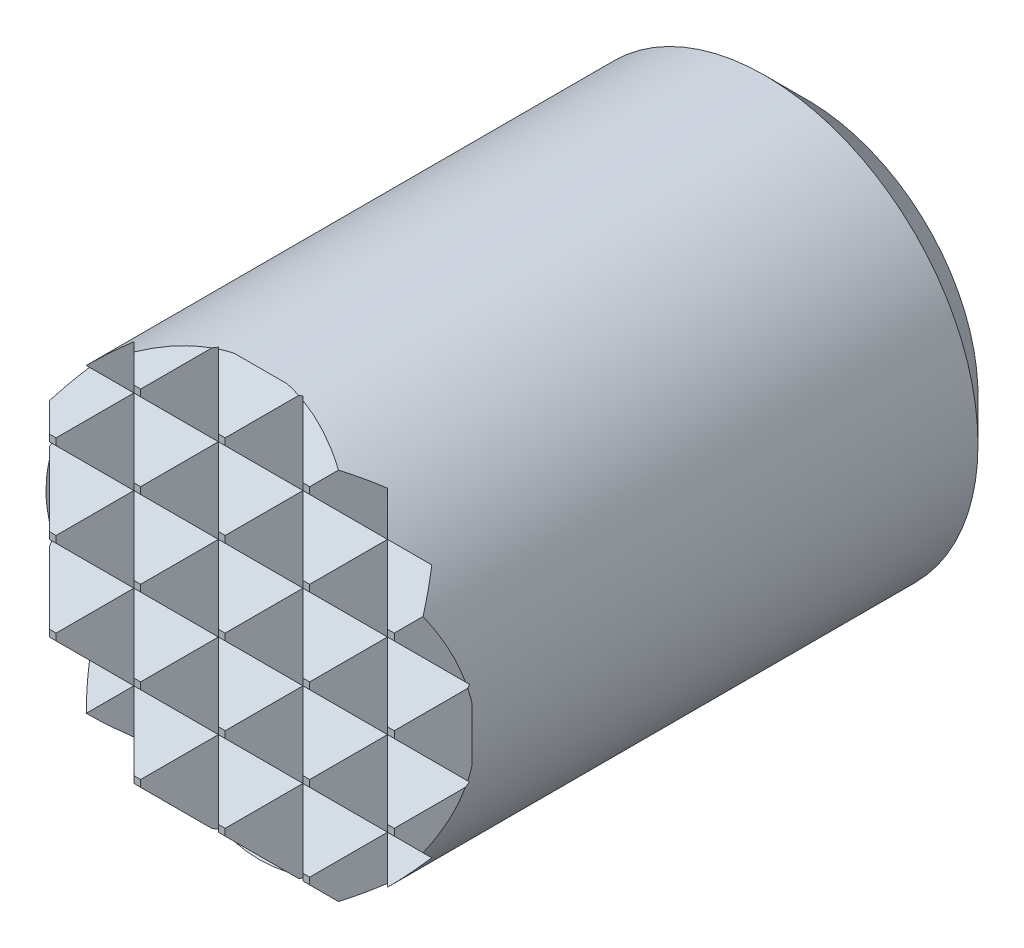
ISO-10303-21;
HEADER;
FILE_DESCRIPTION(('STEP AP214'),'2;1');
FILE_NAME('part.step','',(''),(''),'','','');
FILE_SCHEMA(('AUTOMOTIVE_DESIGN { 1 0 10303 214 1 1 1 1 }'));
ENDSEC;
DATA;
#1=APPLICATION_CONTEXT('core data for automotive mechanical design processes');
#2=APPLICATION_PROTOCOL_DEFINITION('international standard','automotive_design',2000,#1);
#3=PRODUCT_CONTEXT('',#1,'mechanical');
#4=PRODUCT('Part','Part','',(#3));
#5=PRODUCT_RELATED_PRODUCT_CATEGORY('part','',(#4));
#6=PRODUCT_DEFINITION_FORMATION('','',#4);
#7=PRODUCT_DEFINITION_CONTEXT('part definition',#1,'design');
#8=PRODUCT_DEFINITION('design','',#6,#7);
#9=PRODUCT_DEFINITION_SHAPE('','',#8);
#10=(LENGTH_UNIT() NAMED_UNIT(*) SI_UNIT(.MILLI.,.METRE.));
#11=(NAMED_UNIT(*) PLANE_ANGLE_UNIT() SI_UNIT($,.RADIAN.));
#12=(NAMED_UNIT(*) SI_UNIT($,.STERADIAN.) SOLID_ANGLE_UNIT());
#13=UNCERTAINTY_MEASURE_WITH_UNIT(LENGTH_MEASURE(1.E-05),#10,'distance_accuracy_value','');
#14=(GEOMETRIC_REPRESENTATION_CONTEXT(3) GLOBAL_UNCERTAINTY_ASSIGNED_CONTEXT((#13)) GLOBAL_UNIT_ASSIGNED_CONTEXT((#10,
#11,#12)) REPRESENTATION_CONTEXT('',''));
#15=CARTESIAN_POINT('',(0.,0.,0.));
#16=DIRECTION('',(0.,0.,1.));
#17=DIRECTION('',(1.,0.,0.));
#18=AXIS2_PLACEMENT_3D('',#15,#16,#17);
#19=CARTESIAN_POINT('',(0.,0.,11.));
#20=DIRECTION('',(0.,0.,1.));
#21=DIRECTION('',(1.,0.,0.));
#22=AXIS2_PLACEMENT_3D('',#19,#20,#21);
#23=PLANE('',#22);
#24=DIRECTION('',(0.,1.,0.));
#25=VECTOR('',#24,1.);
#26=CARTESIAN_POINT('',(-1.65100000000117,0.,11.));
#27=LINE('',#26,#25);
#28=CARTESIAN_POINT('',(-1.65100000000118,-1.65100000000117,11.));
#29=VERTEX_POINT('',#28);
#30=CARTESIAN_POINT('',(-1.65100000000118,-1.52399999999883,11.));
#31=VERTEX_POINT('',#30);
#32=EDGE_CURVE('E998',#29,#31,#27,.T.);
#33=ORIENTED_EDGE('',*,*,#32,.F.);
#34=DIRECTION('',(-1.,0.,0.));
#35=VECTOR('',#34,1.);
#36=CARTESIAN_POINT('',(0.,-1.65100000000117,11.));
#37=LINE('',#36,#35);
#38=CARTESIAN_POINT('',(-1.52399999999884,-1.65100000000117,11.));
#39=VERTEX_POINT('',#38);
#40=EDGE_CURVE('E1879',#39,#29,#37,.T.);
#41=ORIENTED_EDGE('',*,*,#40,.F.);
#42=DIRECTION('',(0.,-1.,0.));
#43=VECTOR('',#42,1.);
#44=CARTESIAN_POINT('',(-1.52399999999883,0.,11.));
#45=LINE('',#44,#43);
#46=CARTESIAN_POINT('',(-1.52399999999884,-1.52399999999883,11.));
#47=VERTEX_POINT('',#46);
#48=EDGE_CURVE('E921',#47,#39,#45,.T.);
#49=ORIENTED_EDGE('',*,*,#48,.F.);
#50=DIRECTION('',(1.,0.,0.));
#51=VECTOR('',#50,1.);
#52=CARTESIAN_POINT('',(0.,-1.52399999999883,11.));
#53=LINE('',#52,#51);
#54=EDGE_CURVE('E567',#31,#47,#53,.T.);
#55=ORIENTED_EDGE('',*,*,#54,.F.);
#56=EDGE_LOOP('',(#33,#41,#49,#55));
#57=FACE_BOUND('',#56,.T.);
#58=ADVANCED_FACE('F15',(#57),#23,.T.);
#59=DIRECTION('',(0.,1.,0.));
#60=VECTOR('',#59,1.);
#61=CARTESIAN_POINT('',(-1.65100000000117,0.,11.));
#62=LINE('',#61,#60);
#63=CARTESIAN_POINT('',(-1.65100000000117,-0.0635000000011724,11.));
#64=VERTEX_POINT('',#63);
#65=CARTESIAN_POINT('',(-1.65100000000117,0.0635000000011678,11.));
#66=VERTEX_POINT('',#65);
#67=EDGE_CURVE('E990',#64,#66,#62,.T.);
#68=ORIENTED_EDGE('',*,*,#67,.F.);
#69=DIRECTION('',(-1.,0.,0.));
#70=VECTOR('',#69,1.);
#71=CARTESIAN_POINT('',(0.,-0.0635000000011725,11.));
#72=LINE('',#71,#70);
#73=CARTESIAN_POINT('',(-1.52399999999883,-0.0635000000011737,11.));
#74=VERTEX_POINT('',#73);
#75=EDGE_CURVE('E1987',#74,#64,#72,.T.);
#76=ORIENTED_EDGE('',*,*,#75,.F.);
#77=DIRECTION('',(0.,-1.,0.));
#78=VECTOR('',#77,1.);
#79=CARTESIAN_POINT('',(-1.52399999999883,0.,11.));
#80=LINE('',#79,#78);
#81=CARTESIAN_POINT('',(-1.52399999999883,0.0635000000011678,11.));
#82=VERTEX_POINT('',#81);
#83=EDGE_CURVE('E913',#82,#74,#80,.T.);
#84=ORIENTED_EDGE('',*,*,#83,.F.);
#85=DIRECTION('',(1.,0.,0.));
#86=VECTOR('',#85,1.);
#87=CARTESIAN_POINT('',(0.,0.0635000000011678,11.));
#88=LINE('',#87,#86);
#89=EDGE_CURVE('E576',#66,#82,#88,.T.);
#90=ORIENTED_EDGE('',*,*,#89,.F.);
#91=EDGE_LOOP('',(#68,#76,#84,#90));
#92=FACE_BOUND('',#91,.T.);
#93=ADVANCED_FACE('F1062',(#92),#23,.T.);
#94=DIRECTION('',(0.,1.,0.));
#95=VECTOR('',#94,1.);
#96=CARTESIAN_POINT('',(-1.65100000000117,0.,11.));
#97=LINE('',#96,#95);
#98=CARTESIAN_POINT('',(-1.65100000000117,1.52399999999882,11.));
#99=VERTEX_POINT('',#98);
#100=CARTESIAN_POINT('',(-1.65100000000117,1.65100000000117,11.));
#101=VERTEX_POINT('',#100);
#102=EDGE_CURVE('E982',#99,#101,#97,.T.);
#103=ORIENTED_EDGE('',*,*,#102,.F.);
#104=DIRECTION('',(-1.,0.,0.));
#105=VECTOR('',#104,1.);
#106=CARTESIAN_POINT('',(0.,1.52399999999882,11.));
#107=LINE('',#106,#105);
#108=CARTESIAN_POINT('',(-1.52399999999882,1.52399999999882,11.));
#109=VERTEX_POINT('',#108);
#110=EDGE_CURVE('E1954',#109,#99,#107,.T.);
#111=ORIENTED_EDGE('',*,*,#110,.F.);
#112=DIRECTION('',(0.,-1.,0.));
#113=VECTOR('',#112,1.);
#114=CARTESIAN_POINT('',(-1.52399999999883,0.,11.));
#115=LINE('',#114,#113);
#116=CARTESIAN_POINT('',(-1.52399999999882,1.65100000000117,11.));
#117=VERTEX_POINT('',#116);
#118=EDGE_CURVE('E905',#117,#109,#115,.T.);
#119=ORIENTED_EDGE('',*,*,#118,.F.);
#120=DIRECTION('',(1.,0.,0.));
#121=VECTOR('',#120,1.);
#122=CARTESIAN_POINT('',(0.,1.65100000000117,11.));
#123=LINE('',#122,#121);
#124=EDGE_CURVE('E585',#101,#117,#123,.T.);
#125=ORIENTED_EDGE('',*,*,#124,.F.);
#126=EDGE_LOOP('',(#103,#111,#119,#125));
#127=FACE_BOUND('',#126,.T.);
#128=ADVANCED_FACE('F1070',(#127),#23,.T.);
#129=CARTESIAN_POINT('',(-4.,2.38125,10.2697500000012));
#130=DIRECTION('',(0.,0.70710678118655,-0.707106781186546));
#131=DIRECTION('',(0.,0.707106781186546,0.70710678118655));
#132=AXIS2_PLACEMENT_3D('',#129,#130,#131);
#133=PLANE('',#132);
#134=DIRECTION('',(-1.,0.,0.));
#135=VECTOR('',#134,1.);
#136=CARTESIAN_POINT('',(0.,3.11149999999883,11.));
#137=LINE('',#136,#135);
#138=CARTESIAN_POINT('',(-1.52399999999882,3.11149999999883,11.));
#139=VERTEX_POINT('',#138);
#140=CARTESIAN_POINT('',(-1.65100000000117,3.11149999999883,11.));
#141=VERTEX_POINT('',#140);
#142=EDGE_CURVE('E582',#139,#141,#137,.T.);
#143=ORIENTED_EDGE('',*,*,#142,.T.);
#144=DIRECTION('',(-0.577350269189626,-0.577350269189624,-0.577350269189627));
#145=VECTOR('',#144,1.);
#146=CARTESIAN_POINT('',(-2.92083333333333,1.84166666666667,9.73016666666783));
#147=LINE('',#146,#145);
#148=CARTESIAN_POINT('',(-2.38125,2.38125,10.2697500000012));
#149=VERTEX_POINT('',#148);
#150=EDGE_CURVE('E976',#141,#149,#147,.T.);
#151=ORIENTED_EDGE('',*,*,#150,.T.);
#152=DIRECTION('',(1.,0.,0.));
#153=VECTOR('',#152,1.);
#154=CARTESIAN_POINT('',(-4.,2.38125,10.2697500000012));
#155=LINE('',#154,#153);
#156=CARTESIAN_POINT('',(-0.793749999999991,2.38125,10.2697500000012));
#157=VERTEX_POINT('',#156);
#158=EDGE_CURVE('E611',#149,#157,#155,.T.);
#159=ORIENTED_EDGE('',*,*,#158,.T.);
#160=DIRECTION('',(-0.577350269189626,0.577350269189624,0.577350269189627));
#161=VECTOR('',#160,1.);
#162=CARTESIAN_POINT('',(-1.8625,3.45,11.3385000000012));
#163=LINE('',#162,#161);
#164=EDGE_CURVE('E899',#157,#139,#163,.T.);
#165=ORIENTED_EDGE('',*,*,#164,.T.);
#166=EDGE_LOOP('',(#143,#151,#159,#165));
#167=FACE_BOUND('',#166,.T.);
#168=ADVANCED_FACE('F1104',(#167),#133,.F.);
#169=CARTESIAN_POINT('',(-4.,1.5875,11.0635000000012));
#170=DIRECTION('',(0.,-0.707106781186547,-0.707106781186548));
#171=DIRECTION('',(0.,0.707106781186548,-0.707106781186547));
#172=AXIS2_PLACEMENT_3D('',#169,#170,#171);
#173=PLANE('',#172);
#174=ORIENTED_EDGE('',*,*,#158,.F.);
#175=DIRECTION('',(0.577350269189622,-0.577350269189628,0.577350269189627));
#176=VECTOR('',#175,1.);
#177=CARTESIAN_POINT('',(-2.39166666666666,2.39166666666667,10.2593333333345));
#178=LINE('',#177,#176);
#179=EDGE_CURVE('E979',#149,#101,#178,.T.);
#180=ORIENTED_EDGE('',*,*,#179,.T.);
#181=ORIENTED_EDGE('',*,*,#124,.T.);
#182=DIRECTION('',(0.577350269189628,0.577350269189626,-0.577350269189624));
#183=VECTOR('',#182,1.);
#184=CARTESIAN_POINT('',(-2.39166666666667,0.783333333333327,11.8676666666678));
#185=LINE('',#184,#183);
#186=EDGE_CURVE('E902',#117,#157,#185,.T.);
#187=ORIENTED_EDGE('',*,*,#186,.T.);
#188=EDGE_LOOP('',(#174,#180,#181,#187));
#189=FACE_BOUND('',#188,.T.);
#190=ADVANCED_FACE('F1322',(#189),#173,.F.);
#191=CARTESIAN_POINT('',(-4.,0.79375,10.2697500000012));
#192=DIRECTION('',(0.,0.70710678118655,-0.707106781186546));
#193=DIRECTION('',(0.,0.707106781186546,0.70710678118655));
#194=AXIS2_PLACEMENT_3D('',#191,#192,#193);
#195=PLANE('',#194);
#196=ORIENTED_EDGE('',*,*,#110,.T.);
#197=DIRECTION('',(-0.577350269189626,-0.577350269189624,-0.577350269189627));
#198=VECTOR('',#197,1.);
#199=CARTESIAN_POINT('',(-2.92083333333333,0.254166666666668,9.73016666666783));
#200=LINE('',#199,#198);
#201=CARTESIAN_POINT('',(-2.38125,0.79375,10.2697500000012));
#202=VERTEX_POINT('',#201);
#203=EDGE_CURVE('E984',#99,#202,#200,.T.);
#204=ORIENTED_EDGE('',*,*,#203,.T.);
#205=DIRECTION('',(1.,0.,0.));
#206=VECTOR('',#205,1.);
#207=CARTESIAN_POINT('',(-4.,0.79375,10.2697500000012));
#208=LINE('',#207,#206);
#209=CARTESIAN_POINT('',(-0.79375,0.79375,10.2697500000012));
#210=VERTEX_POINT('',#209);
#211=EDGE_CURVE('E623',#202,#210,#208,.T.);
#212=ORIENTED_EDGE('',*,*,#211,.T.);
#213=DIRECTION('',(-0.577350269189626,0.577350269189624,0.577350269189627));
#214=VECTOR('',#213,1.);
#215=CARTESIAN_POINT('',(-1.8625,1.8625,11.3385000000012));
#216=LINE('',#215,#214);
#217=EDGE_CURVE('E907',#210,#109,#216,.T.);
#218=ORIENTED_EDGE('',*,*,#217,.T.);
#219=EDGE_LOOP('',(#196,#204,#212,#218));
#220=FACE_BOUND('',#219,.T.);
#221=ADVANCED_FACE('F1312',(#220),#195,.F.);
#222=CARTESIAN_POINT('',(-4.,0.,11.0635000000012));
#223=DIRECTION('',(0.,-0.707106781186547,-0.707106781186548));
#224=DIRECTION('',(0.,0.707106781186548,-0.707106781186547));
#225=AXIS2_PLACEMENT_3D('',#222,#223,#224);
#226=PLANE('',#225);
#227=ORIENTED_EDGE('',*,*,#211,.F.);
#228=DIRECTION('',(0.577350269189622,-0.577350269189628,0.577350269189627));
#229=VECTOR('',#228,1.);
#230=CARTESIAN_POINT('',(-2.39166666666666,0.804166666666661,10.2593333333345));
#231=LINE('',#230,#229);
#232=EDGE_CURVE('E987',#202,#66,#231,.T.);
#233=ORIENTED_EDGE('',*,*,#232,.T.);
#234=ORIENTED_EDGE('',*,*,#89,.T.);
#235=DIRECTION('',(0.577350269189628,0.577350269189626,-0.577350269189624));
#236=VECTOR('',#235,1.);
#237=CARTESIAN_POINT('',(-2.39166666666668,-0.804166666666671,11.8676666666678));
#238=LINE('',#237,#236);
#239=EDGE_CURVE('E910',#82,#210,#238,.T.);
#240=ORIENTED_EDGE('',*,*,#239,.T.);
#241=EDGE_LOOP('',(#227,#233,#234,#240));
#242=FACE_BOUND('',#241,.T.);
#243=ADVANCED_FACE('F1316',(#242),#226,.F.);
#244=CARTESIAN_POINT('',(-4.,-0.79375,10.2697500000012));
#245=DIRECTION('',(0.,0.70710678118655,-0.707106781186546));
#246=DIRECTION('',(0.,0.707106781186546,0.70710678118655));
#247=AXIS2_PLACEMENT_3D('',#244,#245,#246);
#248=PLANE('',#247);
#249=ORIENTED_EDGE('',*,*,#75,.T.);
#250=DIRECTION('',(-0.577350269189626,-0.577350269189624,-0.577350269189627));
#251=VECTOR('',#250,1.);
#252=CARTESIAN_POINT('',(-2.92083333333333,-1.33333333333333,9.73016666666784));
#253=LINE('',#252,#251);
#254=CARTESIAN_POINT('',(-2.38125,-0.79375,10.2697500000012));
#255=VERTEX_POINT('',#254);
#256=EDGE_CURVE('E992',#64,#255,#253,.T.);
#257=ORIENTED_EDGE('',*,*,#256,.T.);
#258=DIRECTION('',(1.,0.,0.));
#259=VECTOR('',#258,1.);
#260=CARTESIAN_POINT('',(-4.,-0.79375,10.2697500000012));
#261=LINE('',#260,#259);
#262=CARTESIAN_POINT('',(-0.79375,-0.79375,10.2697500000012));
#263=VERTEX_POINT('',#262);
#264=EDGE_CURVE('E635',#255,#263,#261,.T.);
#265=ORIENTED_EDGE('',*,*,#264,.T.);
#266=DIRECTION('',(-0.577350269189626,0.577350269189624,0.577350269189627));
#267=VECTOR('',#266,1.);
#268=CARTESIAN_POINT('',(-1.8625,0.275,11.3385000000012));
#269=LINE('',#268,#267);
#270=EDGE_CURVE('E915',#263,#74,#269,.T.);
#271=ORIENTED_EDGE('',*,*,#270,.T.);
#272=EDGE_LOOP('',(#249,#257,#265,#271));
#273=FACE_BOUND('',#272,.T.);
#274=ADVANCED_FACE('F1306',(#273),#248,.F.);
#275=CARTESIAN_POINT('',(-4.,-1.5875,11.0635000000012));
#276=DIRECTION('',(0.,-0.707106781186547,-0.707106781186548));
#277=DIRECTION('',(0.,0.707106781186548,-0.707106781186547));
#278=AXIS2_PLACEMENT_3D('',#275,#276,#277);
#279=PLANE('',#278);
#280=ORIENTED_EDGE('',*,*,#264,.F.);
#281=DIRECTION('',(0.577350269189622,-0.577350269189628,0.577350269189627));
#282=VECTOR('',#281,1.);
#283=CARTESIAN_POINT('',(-2.39166666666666,-0.78333333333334,10.2593333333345));
#284=LINE('',#283,#282);
#285=EDGE_CURVE('E995',#255,#31,#284,.T.);
#286=ORIENTED_EDGE('',*,*,#285,.T.);
#287=ORIENTED_EDGE('',*,*,#54,.T.);
#288=DIRECTION('',(0.577350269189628,0.577350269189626,-0.577350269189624));
#289=VECTOR('',#288,1.);
#290=CARTESIAN_POINT('',(-2.39166666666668,-2.39166666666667,11.8676666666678));
#291=LINE('',#290,#289);
#292=EDGE_CURVE('E918',#47,#263,#291,.T.);
#293=ORIENTED_EDGE('',*,*,#292,.T.);
#294=EDGE_LOOP('',(#280,#286,#287,#293));
#295=FACE_BOUND('',#294,.T.);
#296=ADVANCED_FACE('F1300',(#295),#279,.F.);
#297=CARTESIAN_POINT('',(-4.,-2.38125,10.2697500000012));
#298=DIRECTION('',(0.,0.70710678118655,-0.707106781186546));
#299=DIRECTION('',(0.,0.707106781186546,0.70710678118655));
#300=AXIS2_PLACEMENT_3D('',#297,#298,#299);
#301=PLANE('',#300);
#302=ORIENTED_EDGE('',*,*,#40,.T.);
#303=DIRECTION('',(-0.577350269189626,-0.577350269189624,-0.577350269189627));
#304=VECTOR('',#303,1.);
#305=CARTESIAN_POINT('',(-2.92083333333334,-2.92083333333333,9.73016666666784));
#306=LINE('',#305,#304);
#307=CARTESIAN_POINT('',(-2.38125,-2.38125,10.2697500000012));
#308=VERTEX_POINT('',#307);
#309=EDGE_CURVE('E1000',#29,#308,#306,.T.);
#310=ORIENTED_EDGE('',*,*,#309,.T.);
#311=DIRECTION('',(1.,0.,0.));
#312=VECTOR('',#311,1.);
#313=CARTESIAN_POINT('',(-4.,-2.38125,10.2697500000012));
#314=LINE('',#313,#312);
#315=CARTESIAN_POINT('',(-0.79375,-2.38125,10.2697500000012));
#316=VERTEX_POINT('',#315);
#317=EDGE_CURVE('E647',#308,#316,#314,.T.);
#318=ORIENTED_EDGE('',*,*,#317,.T.);
#319=DIRECTION('',(-0.577350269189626,0.577350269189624,0.577350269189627));
#320=VECTOR('',#319,1.);
#321=CARTESIAN_POINT('',(-1.8625,-1.3125,11.3385000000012));
#322=LINE('',#321,#320);
#323=EDGE_CURVE('E923',#316,#39,#322,.T.);
#324=ORIENTED_EDGE('',*,*,#323,.T.);
#325=EDGE_LOOP('',(#302,#310,#318,#324));
#326=FACE_BOUND('',#325,.T.);
#327=ADVANCED_FACE('F1294',(#326),#301,.F.);
#328=CARTESIAN_POINT('',(-4.,-3.175,11.0635000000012));
#329=DIRECTION('',(0.,-0.707106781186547,-0.707106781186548));
#330=DIRECTION('',(0.,0.707106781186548,-0.707106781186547));
#331=AXIS2_PLACEMENT_3D('',#328,#329,#330);
#332=PLANE('',#331);
#333=ORIENTED_EDGE('',*,*,#317,.F.);
#334=DIRECTION('',(0.577350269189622,-0.577350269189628,0.577350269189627));
#335=VECTOR('',#334,1.);
#336=CARTESIAN_POINT('',(-2.39166666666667,-2.37083333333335,10.2593333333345));
#337=LINE('',#336,#335);
#338=CARTESIAN_POINT('',(-1.65100000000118,-3.11149999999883,11.));
#339=VERTEX_POINT('',#338);
#340=EDGE_CURVE('E1003',#308,#339,#337,.T.);
#341=ORIENTED_EDGE('',*,*,#340,.T.);
#342=DIRECTION('',(1.,0.,0.));
#343=VECTOR('',#342,1.);
#344=CARTESIAN_POINT('',(0.,-3.11149999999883,11.));
#345=LINE('',#344,#343);
#346=CARTESIAN_POINT('',(-1.52399999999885,-3.11149999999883,11.));
#347=VERTEX_POINT('',#346);
#348=EDGE_CURVE('E556',#339,#347,#345,.T.);
#349=ORIENTED_EDGE('',*,*,#348,.T.);
#350=DIRECTION('',(0.577350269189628,0.577350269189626,-0.577350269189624));
#351=VECTOR('',#350,1.);
#352=CARTESIAN_POINT('',(-2.39166666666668,-3.97916666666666,11.8676666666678));
#353=LINE('',#352,#351);
#354=EDGE_CURVE('E926',#347,#316,#353,.T.);
#355=ORIENTED_EDGE('',*,*,#354,.T.);
#356=EDGE_LOOP('',(#333,#341,#349,#355));
#357=FACE_BOUND('',#356,.T.);
#358=ADVANCED_FACE('F1267',(#357),#332,.F.);
#359=DIRECTION('',(0.,1.,0.));
#360=VECTOR('',#359,1.);
#361=CARTESIAN_POINT('',(-0.0635000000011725,0.,11.));
#362=LINE('',#361,#360);
#363=CARTESIAN_POINT('',(-0.0635000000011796,-1.65100000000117,11.));
#364=VERTEX_POINT('',#363);
#365=CARTESIAN_POINT('',(-0.0635000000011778,-1.52399999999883,11.));
#366=VERTEX_POINT('',#365);
#367=EDGE_CURVE('E880',#364,#366,#362,.T.);
#368=ORIENTED_EDGE('',*,*,#367,.F.);
#369=CARTESIAN_POINT('',(0.0635000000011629,-1.65100000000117,11.));
#370=VERTEX_POINT('',#369);
#371=EDGE_CURVE('E1261',#370,#364,#37,.T.);
#372=ORIENTED_EDGE('',*,*,#371,.F.);
#373=DIRECTION('',(0.,-1.,0.));
#374=VECTOR('',#373,1.);
#375=CARTESIAN_POINT('',(0.0635000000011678,0.,11.));
#376=LINE('',#375,#374);
#377=CARTESIAN_POINT('',(0.0635000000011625,-1.52399999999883,11.));
#378=VERTEX_POINT('',#377);
#379=EDGE_CURVE('E834',#378,#370,#376,.T.);
#380=ORIENTED_EDGE('',*,*,#379,.F.);
#381=EDGE_CURVE('E1912',#366,#378,#53,.T.);
#382=ORIENTED_EDGE('',*,*,#381,.F.);
#383=EDGE_LOOP('',(#368,#372,#380,#382));
#384=FACE_BOUND('',#383,.T.);
#385=ADVANCED_FACE('F1916',(#384),#23,.T.);
#386=DIRECTION('',(0.,1.,0.));
#387=VECTOR('',#386,1.);
#388=CARTESIAN_POINT('',(-0.0635000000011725,0.,11.));
#389=LINE('',#388,#387);
#390=CARTESIAN_POINT('',(-0.0635000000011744,-0.0635000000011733,11.));
#391=VERTEX_POINT('',#390);
#392=CARTESIAN_POINT('',(-0.0635000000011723,0.0635000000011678,11.));
#393=VERTEX_POINT('',#392);
#394=EDGE_CURVE('E872',#391,#393,#389,.T.);
#395=ORIENTED_EDGE('',*,*,#394,.F.);
#396=CARTESIAN_POINT('',(0.0635000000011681,-0.0635000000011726,11.));
#397=VERTEX_POINT('',#396);
#398=EDGE_CURVE('E2161',#397,#391,#72,.T.);
#399=ORIENTED_EDGE('',*,*,#398,.F.);
#400=DIRECTION('',(0.,-1.,0.));
#401=VECTOR('',#400,1.);
#402=CARTESIAN_POINT('',(0.0635000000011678,0.,11.));
#403=LINE('',#402,#401);
#404=CARTESIAN_POINT('',(0.063500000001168,0.0635000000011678,11.));
#405=VERTEX_POINT('',#404);
#406=EDGE_CURVE('E826',#405,#397,#403,.T.);
#407=ORIENTED_EDGE('',*,*,#406,.F.);
#408=EDGE_CURVE('E1992',#393,#405,#88,.T.);
#409=ORIENTED_EDGE('',*,*,#408,.F.);
#410=EDGE_LOOP('',(#395,#399,#407,#409));
#411=FACE_BOUND('',#410,.T.);
#412=ADVANCED_FACE('F2146',(#411),#23,.T.);
#413=DIRECTION('',(0.,1.,0.));
#414=VECTOR('',#413,1.);
#415=CARTESIAN_POINT('',(-0.0635000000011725,0.,11.));
#416=LINE('',#415,#414);
#417=CARTESIAN_POINT('',(-0.0635000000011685,1.52399999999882,11.));
#418=VERTEX_POINT('',#417);
#419=CARTESIAN_POINT('',(-0.0635000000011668,1.65100000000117,11.));
#420=VERTEX_POINT('',#419);
#421=EDGE_CURVE('E864',#418,#420,#416,.T.);
#422=ORIENTED_EDGE('',*,*,#421,.F.);
#423=CARTESIAN_POINT('',(0.0635000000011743,1.52399999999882,11.));
#424=VERTEX_POINT('',#423);
#425=EDGE_CURVE('E2166',#424,#418,#107,.T.);
#426=ORIENTED_EDGE('',*,*,#425,.F.);
#427=DIRECTION('',(0.,-1.,0.));
#428=VECTOR('',#427,1.);
#429=CARTESIAN_POINT('',(0.0635000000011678,0.,11.));
#430=LINE('',#429,#428);
#431=CARTESIAN_POINT('',(0.0635000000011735,1.65100000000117,11.));
#432=VERTEX_POINT('',#431);
#433=EDGE_CURVE('E818',#432,#424,#430,.T.);
#434=ORIENTED_EDGE('',*,*,#433,.F.);
#435=EDGE_CURVE('E1183',#420,#432,#123,.T.);
#436=ORIENTED_EDGE('',*,*,#435,.F.);
#437=EDGE_LOOP('',(#422,#426,#434,#436));
#438=FACE_BOUND('',#437,.T.);
#439=ADVANCED_FACE('F2151',(#438),#23,.T.);
#440=DIRECTION('',(0.,1.,0.));
#441=VECTOR('',#440,1.);
#442=CARTESIAN_POINT('',(-0.0635000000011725,0.,11.));
#443=LINE('',#442,#441);
#444=CARTESIAN_POINT('',(-0.0635000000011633,3.11149999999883,11.));
#445=VERTEX_POINT('',#444);
#446=CARTESIAN_POINT('',(-0.0635000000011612,3.23850000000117,11.));
#447=VERTEX_POINT('',#446);
#448=EDGE_CURVE('E856',#445,#447,#443,.T.);
#449=ORIENTED_EDGE('',*,*,#448,.F.);
#450=CARTESIAN_POINT('',(0.0635000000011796,3.11149999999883,11.));
#451=VERTEX_POINT('',#450);
#452=EDGE_CURVE('E581',#451,#445,#137,.T.);
#453=ORIENTED_EDGE('',*,*,#452,.F.);
#454=DIRECTION('',(0.,-1.,0.));
#455=VECTOR('',#454,1.);
#456=CARTESIAN_POINT('',(0.0635000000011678,0.,11.));
#457=LINE('',#456,#455);
#458=CARTESIAN_POINT('',(0.0635000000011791,3.23850000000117,11.));
#459=VERTEX_POINT('',#458);
#460=EDGE_CURVE('E810',#459,#451,#457,.T.);
#461=ORIENTED_EDGE('',*,*,#460,.F.);
#462=DIRECTION('',(1.,0.,0.));
#463=VECTOR('',#462,1.);
#464=CARTESIAN_POINT('',(0.,3.23850000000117,11.));
#465=LINE('',#464,#463);
#466=EDGE_CURVE('E592',#447,#459,#465,.T.);
#467=ORIENTED_EDGE('',*,*,#466,.F.);
#468=EDGE_LOOP('',(#449,#453,#461,#467));
#469=FACE_BOUND('',#468,.T.);
#470=ADVANCED_FACE('F1114',(#469),#23,.T.);
#471=DIRECTION('',(0.,1.,0.));
#472=VECTOR('',#471,1.);
#473=CARTESIAN_POINT('',(-0.0635000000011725,0.,11.));
#474=LINE('',#473,#472);
#475=CARTESIAN_POINT('',(-0.0635000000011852,-3.23850000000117,11.));
#476=VERTEX_POINT('',#475);
#477=CARTESIAN_POINT('',(-0.0635000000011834,-3.11149999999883,11.));
#478=VERTEX_POINT('',#477);
#479=EDGE_CURVE('E891',#476,#478,#474,.T.);
#480=ORIENTED_EDGE('',*,*,#479,.F.);
#481=DIRECTION('',(-1.,0.,0.));
#482=VECTOR('',#481,1.);
#483=CARTESIAN_POINT('',(0.,-3.23850000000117,11.));
#484=LINE('',#483,#482);
#485=CARTESIAN_POINT('',(0.0635000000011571,-3.23850000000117,11.));
#486=VERTEX_POINT('',#485);
#487=EDGE_CURVE('E549',#486,#476,#484,.T.);
#488=ORIENTED_EDGE('',*,*,#487,.F.);
#489=DIRECTION('',(0.,-1.,0.));
#490=VECTOR('',#489,1.);
#491=CARTESIAN_POINT('',(0.0635000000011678,0.,11.));
#492=LINE('',#491,#490);
#493=CARTESIAN_POINT('',(0.0635000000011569,-3.11149999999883,11.));
#494=VERTEX_POINT('',#493);
#495=EDGE_CURVE('E845',#494,#486,#492,.T.);
#496=ORIENTED_EDGE('',*,*,#495,.F.);
#497=EDGE_CURVE('E558',#478,#494,#345,.T.);
#498=ORIENTED_EDGE('',*,*,#497,.F.);
#499=EDGE_LOOP('',(#480,#488,#496,#498));
#500=FACE_BOUND('',#499,.T.);
#501=ADVANCED_FACE('F1244',(#500),#23,.T.);
#502=CARTESIAN_POINT('',(-4.,3.175,11.0635000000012));
#503=DIRECTION('',(0.,-0.707106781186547,-0.707106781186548));
#504=DIRECTION('',(0.,0.707106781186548,-0.707106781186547));
#505=AXIS2_PLACEMENT_3D('',#502,#503,#504);
#506=PLANE('',#505);
#507=CARTESIAN_POINT('',(0.,0.,14.2385000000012));
#508=DIRECTION('',(0.,-0.707106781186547,-0.707106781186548));
#509=DIRECTION('',(0.,0.707106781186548,-0.707106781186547));
#510=AXIS2_PLACEMENT_3D('',#507,#508,#509);
#511=ELLIPSE('',#510,5.65685424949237,4.);
#512=CARTESIAN_POINT('',(-0.753406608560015,3.92840660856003,10.3100933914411));
#513=VERTEX_POINT('',#512);
#514=CARTESIAN_POINT('',(-0.499022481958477,3.96875,10.2697500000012));
#515=VERTEX_POINT('',#514);
#516=EDGE_CURVE('E597',#513,#515,#511,.T.);
#517=ORIENTED_EDGE('',*,*,#516,.F.);
#518=DIRECTION('',(0.577350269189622,-0.577350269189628,0.577350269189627));
#519=VECTOR('',#518,1.);
#520=CARTESIAN_POINT('',(-1.33333333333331,4.50833333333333,9.73016666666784));
#521=LINE('',#520,#519);
#522=EDGE_CURVE('E853',#513,#447,#521,.T.);
#523=ORIENTED_EDGE('',*,*,#522,.T.);
#524=ORIENTED_EDGE('',*,*,#466,.T.);
#525=DIRECTION('',(0.577350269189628,0.577350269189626,-0.577350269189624));
#526=VECTOR('',#525,1.);
#527=CARTESIAN_POINT('',(-1.33333333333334,1.84166666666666,12.3968333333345));
#528=LINE('',#527,#526);
#529=CARTESIAN_POINT('',(0.753406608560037,3.92840660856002,10.3100933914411));
#530=VERTEX_POINT('',#529);
#531=EDGE_CURVE('E807',#459,#530,#528,.T.);
#532=ORIENTED_EDGE('',*,*,#531,.T.);
#533=CARTESIAN_POINT('',(0.499022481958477,3.96875,10.2697500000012));
#534=VERTEX_POINT('',#533);
#535=EDGE_CURVE('E598',#534,#530,#511,.T.);
#536=ORIENTED_EDGE('',*,*,#535,.F.);
#537=DIRECTION('',(1.,0.,0.));
#538=VECTOR('',#537,1.);
#539=CARTESIAN_POINT('',(-4.,3.96875,10.2697500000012));
#540=LINE('',#539,#538);
#541=EDGE_CURVE('E599',#515,#534,#540,.T.);
#542=ORIENTED_EDGE('',*,*,#541,.F.);
#543=EDGE_LOOP('',(#517,#523,#524,#532,#536,#542));
#544=FACE_BOUND('',#543,.T.);
#545=ADVANCED_FACE('F1122',(#544),#506,.F.);
#546=ORIENTED_EDGE('',*,*,#452,.T.);
#547=DIRECTION('',(-0.577350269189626,-0.577350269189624,-0.577350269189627));
#548=VECTOR('',#547,1.);
#549=CARTESIAN_POINT('',(-1.8625,1.3125,9.20100000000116));
#550=LINE('',#549,#548);
#551=EDGE_CURVE('E858',#445,#157,#550,.T.);
#552=ORIENTED_EDGE('',*,*,#551,.T.);
#553=CARTESIAN_POINT('',(0.793750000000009,2.38125,10.2697500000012));
#554=VERTEX_POINT('',#553);
#555=EDGE_CURVE('E1942',#157,#554,#155,.T.);
#556=ORIENTED_EDGE('',*,*,#555,.T.);
#557=DIRECTION('',(-0.577350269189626,0.577350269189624,0.577350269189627));
#558=VECTOR('',#557,1.);
#559=CARTESIAN_POINT('',(-0.804166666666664,3.97916666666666,11.8676666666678));
#560=LINE('',#559,#558);
#561=EDGE_CURVE('E812',#554,#451,#560,.T.);
#562=ORIENTED_EDGE('',*,*,#561,.T.);
#563=EDGE_LOOP('',(#546,#552,#556,#562));
#564=FACE_BOUND('',#563,.T.);
#565=ADVANCED_FACE('F1109',(#564),#133,.F.);
#566=ORIENTED_EDGE('',*,*,#555,.F.);
#567=DIRECTION('',(0.577350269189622,-0.577350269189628,0.577350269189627));
#568=VECTOR('',#567,1.);
#569=CARTESIAN_POINT('',(-1.33333333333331,2.92083333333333,9.73016666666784));
#570=LINE('',#569,#568);
#571=EDGE_CURVE('E861',#157,#420,#570,.T.);
#572=ORIENTED_EDGE('',*,*,#571,.T.);
#573=ORIENTED_EDGE('',*,*,#435,.T.);
#574=DIRECTION('',(0.577350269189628,0.577350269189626,-0.577350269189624));
#575=VECTOR('',#574,1.);
#576=CARTESIAN_POINT('',(-1.33333333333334,0.254166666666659,12.3968333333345));
#577=LINE('',#576,#575);
#578=EDGE_CURVE('E815',#432,#554,#577,.T.);
#579=ORIENTED_EDGE('',*,*,#578,.T.);
#580=EDGE_LOOP('',(#566,#572,#573,#579));
#581=FACE_BOUND('',#580,.T.);
#582=ADVANCED_FACE('F1943',(#581),#173,.F.);
#583=ORIENTED_EDGE('',*,*,#425,.T.);
#584=DIRECTION('',(-0.577350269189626,-0.577350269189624,-0.577350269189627));
#585=VECTOR('',#584,1.);
#586=CARTESIAN_POINT('',(-1.8625,-0.275,9.20100000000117));
#587=LINE('',#586,#585);
#588=EDGE_CURVE('E866',#418,#210,#587,.T.);
#589=ORIENTED_EDGE('',*,*,#588,.T.);
#590=CARTESIAN_POINT('',(0.79375,0.79375,10.2697500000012));
#591=VERTEX_POINT('',#590);
#592=EDGE_CURVE('E1958',#210,#591,#208,.T.);
#593=ORIENTED_EDGE('',*,*,#592,.T.);
#594=DIRECTION('',(-0.577350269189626,0.577350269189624,0.577350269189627));
#595=VECTOR('',#594,1.);
#596=CARTESIAN_POINT('',(-0.804166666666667,2.39166666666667,11.8676666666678));
#597=LINE('',#596,#595);
#598=EDGE_CURVE('E820',#591,#424,#597,.T.);
#599=ORIENTED_EDGE('',*,*,#598,.T.);
#600=EDGE_LOOP('',(#583,#589,#593,#599));
#601=FACE_BOUND('',#600,.T.);
#602=ADVANCED_FACE('F2088',(#601),#195,.F.);
#603=ORIENTED_EDGE('',*,*,#592,.F.);
#604=DIRECTION('',(0.577350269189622,-0.577350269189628,0.577350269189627));
#605=VECTOR('',#604,1.);
#606=CARTESIAN_POINT('',(-1.33333333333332,1.33333333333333,9.73016666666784));
#607=LINE('',#606,#605);
#608=EDGE_CURVE('E869',#210,#393,#607,.T.);
#609=ORIENTED_EDGE('',*,*,#608,.T.);
#610=ORIENTED_EDGE('',*,*,#408,.T.);
#611=DIRECTION('',(0.577350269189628,0.577350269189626,-0.577350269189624));
#612=VECTOR('',#611,1.);
#613=CARTESIAN_POINT('',(-1.33333333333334,-1.33333333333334,12.3968333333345));
#614=LINE('',#613,#612);
#615=EDGE_CURVE('E823',#405,#591,#614,.T.);
#616=ORIENTED_EDGE('',*,*,#615,.T.);
#617=EDGE_LOOP('',(#603,#609,#610,#616));
#618=FACE_BOUND('',#617,.T.);
#619=ADVANCED_FACE('F2081',(#618),#226,.F.);
#620=ORIENTED_EDGE('',*,*,#398,.T.);
#621=DIRECTION('',(-0.577350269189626,-0.577350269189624,-0.577350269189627));
#622=VECTOR('',#621,1.);
#623=CARTESIAN_POINT('',(-1.8625,-1.8625,9.20100000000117));
#624=LINE('',#623,#622);
#625=EDGE_CURVE('E874',#391,#263,#624,.T.);
#626=ORIENTED_EDGE('',*,*,#625,.T.);
#627=CARTESIAN_POINT('',(0.79375,-0.79375,10.2697500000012));
#628=VERTEX_POINT('',#627);
#629=EDGE_CURVE('E1210',#263,#628,#261,.T.);
#630=ORIENTED_EDGE('',*,*,#629,.T.);
#631=DIRECTION('',(-0.577350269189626,0.577350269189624,0.577350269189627));
#632=VECTOR('',#631,1.);
#633=CARTESIAN_POINT('',(-0.804166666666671,0.804166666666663,11.8676666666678));
#634=LINE('',#633,#632);
#635=EDGE_CURVE('E828',#628,#397,#634,.T.);
#636=ORIENTED_EDGE('',*,*,#635,.T.);
#637=EDGE_LOOP('',(#620,#626,#630,#636));
#638=FACE_BOUND('',#637,.T.);
#639=ADVANCED_FACE('F2053',(#638),#248,.F.);
#640=ORIENTED_EDGE('',*,*,#629,.F.);
#641=DIRECTION('',(0.577350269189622,-0.577350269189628,0.577350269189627));
#642=VECTOR('',#641,1.);
#643=CARTESIAN_POINT('',(-1.33333333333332,-0.254166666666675,9.73016666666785));
#644=LINE('',#643,#642);
#645=EDGE_CURVE('E877',#263,#366,#644,.T.);
#646=ORIENTED_EDGE('',*,*,#645,.T.);
#647=ORIENTED_EDGE('',*,*,#381,.T.);
#648=DIRECTION('',(0.577350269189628,0.577350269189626,-0.577350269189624));
#649=VECTOR('',#648,1.);
#650=CARTESIAN_POINT('',(-1.33333333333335,-2.92083333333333,12.3968333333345));
#651=LINE('',#650,#649);
#652=EDGE_CURVE('E831',#378,#628,#651,.T.);
#653=ORIENTED_EDGE('',*,*,#652,.T.);
#654=EDGE_LOOP('',(#640,#646,#647,#653));
#655=FACE_BOUND('',#654,.T.);
#656=ADVANCED_FACE('F1910',(#655),#279,.F.);
#657=ORIENTED_EDGE('',*,*,#371,.T.);
#658=DIRECTION('',(-0.577350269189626,-0.577350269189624,-0.577350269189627));
#659=VECTOR('',#658,1.);
#660=CARTESIAN_POINT('',(-1.8625,-3.45,9.20100000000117));
#661=LINE('',#660,#659);
#662=EDGE_CURVE('E882',#364,#316,#661,.T.);
#663=ORIENTED_EDGE('',*,*,#662,.T.);
#664=CARTESIAN_POINT('',(0.79375,-2.38125,10.2697500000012));
#665=VERTEX_POINT('',#664);
#666=EDGE_CURVE('E1254',#316,#665,#314,.T.);
#667=ORIENTED_EDGE('',*,*,#666,.T.);
#668=DIRECTION('',(-0.577350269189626,0.577350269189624,0.577350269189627));
#669=VECTOR('',#668,1.);
#670=CARTESIAN_POINT('',(-0.804166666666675,-0.783333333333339,11.8676666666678));
#671=LINE('',#670,#669);
#672=EDGE_CURVE('E836',#665,#370,#671,.T.);
#673=ORIENTED_EDGE('',*,*,#672,.T.);
#674=EDGE_LOOP('',(#657,#663,#667,#673));
#675=FACE_BOUND('',#674,.T.);
#676=ADVANCED_FACE('F1259',(#675),#301,.F.);
#677=ORIENTED_EDGE('',*,*,#666,.F.);
#678=DIRECTION('',(0.577350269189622,-0.577350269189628,0.577350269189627));
#679=VECTOR('',#678,1.);
#680=CARTESIAN_POINT('',(-1.33333333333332,-1.84166666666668,9.73016666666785));
#681=LINE('',#680,#679);
#682=EDGE_CURVE('E885',#316,#478,#681,.T.);
#683=ORIENTED_EDGE('',*,*,#682,.T.);
#684=ORIENTED_EDGE('',*,*,#497,.T.);
#685=DIRECTION('',(0.577350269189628,0.577350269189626,-0.577350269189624));
#686=VECTOR('',#685,1.);
#687=CARTESIAN_POINT('',(-1.33333333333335,-4.50833333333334,12.3968333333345));
#688=LINE('',#687,#686);
#689=EDGE_CURVE('E839',#494,#665,#688,.T.);
#690=ORIENTED_EDGE('',*,*,#689,.T.);
#691=EDGE_LOOP('',(#677,#683,#684,#690));
#692=FACE_BOUND('',#691,.T.);
#693=ADVANCED_FACE('F1252',(#692),#332,.F.);
#694=CARTESIAN_POINT('',(-4.,-3.96875,10.2697500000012));
#695=DIRECTION('',(0.,0.70710678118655,-0.707106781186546));
#696=DIRECTION('',(0.,0.707106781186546,0.70710678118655));
#697=AXIS2_PLACEMENT_3D('',#694,#695,#696);
#698=PLANE('',#697);
#699=ORIENTED_EDGE('',*,*,#487,.T.);
#700=DIRECTION('',(-0.577350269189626,-0.577350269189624,-0.577350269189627));
#701=VECTOR('',#700,1.);
#702=CARTESIAN_POINT('',(-1.8625,-5.0375,9.20100000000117));
#703=LINE('',#702,#701);
#704=CARTESIAN_POINT('',(-0.753406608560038,-3.92840660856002,10.3100933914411));
#705=VERTEX_POINT('',#704);
#706=EDGE_CURVE('E519',#476,#705,#703,.T.);
#707=ORIENTED_EDGE('',*,*,#706,.T.);
#708=CARTESIAN_POINT('',(0.,0.,14.2385000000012));
#709=DIRECTION('',(0.,0.70710678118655,-0.707106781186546));
#710=DIRECTION('',(0.,-0.707106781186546,-0.70710678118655));
#711=AXIS2_PLACEMENT_3D('',#708,#709,#710);
#712=ELLIPSE('',#711,5.6568542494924,4.);
#713=CARTESIAN_POINT('',(-0.499022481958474,-3.96875,10.2697500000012));
#714=VERTEX_POINT('',#713);
#715=EDGE_CURVE('E654',#714,#705,#712,.T.);
#716=ORIENTED_EDGE('',*,*,#715,.F.);
#717=DIRECTION('',(1.,0.,0.));
#718=VECTOR('',#717,1.);
#719=CARTESIAN_POINT('',(-4.,-3.96875,10.2697500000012));
#720=LINE('',#719,#718);
#721=CARTESIAN_POINT('',(0.499022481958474,-3.96875,10.2697500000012));
#722=VERTEX_POINT('',#721);
#723=EDGE_CURVE('E655',#714,#722,#720,.T.);
#724=ORIENTED_EDGE('',*,*,#723,.T.);
#725=CARTESIAN_POINT('',(0.753406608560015,-3.92840660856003,10.3100933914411));
#726=VERTEX_POINT('',#725);
#727=EDGE_CURVE('E653',#726,#722,#712,.T.);
#728=ORIENTED_EDGE('',*,*,#727,.F.);
#729=DIRECTION('',(-0.577350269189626,0.577350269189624,0.577350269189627));
#730=VECTOR('',#729,1.);
#731=CARTESIAN_POINT('',(-0.804166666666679,-2.37083333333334,11.8676666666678));
#732=LINE('',#731,#730);
#733=EDGE_CURVE('E528',#726,#486,#732,.T.);
#734=ORIENTED_EDGE('',*,*,#733,.T.);
#735=EDGE_LOOP('',(#699,#707,#716,#724,#728,#734));
#736=FACE_BOUND('',#735,.T.);
#737=ADVANCED_FACE('F1238',(#736),#698,.F.);
#738=DIRECTION('',(0.,1.,0.));
#739=VECTOR('',#738,1.);
#740=CARTESIAN_POINT('',(1.52399999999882,0.,11.));
#741=LINE('',#740,#739);
#742=CARTESIAN_POINT('',(1.52399999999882,-1.65100000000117,11.));
#743=VERTEX_POINT('',#742);
#744=CARTESIAN_POINT('',(1.52399999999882,-1.52399999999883,11.));
#745=VERTEX_POINT('',#744);
#746=EDGE_CURVE('E793',#743,#745,#741,.T.);
#747=ORIENTED_EDGE('',*,*,#746,.F.);
#748=CARTESIAN_POINT('',(1.65100000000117,-1.65100000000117,11.));
#749=VERTEX_POINT('',#748);
#750=EDGE_CURVE('E554',#749,#743,#37,.T.);
#751=ORIENTED_EDGE('',*,*,#750,.F.);
#752=DIRECTION('',(0.,-1.,0.));
#753=VECTOR('',#752,1.);
#754=CARTESIAN_POINT('',(1.65100000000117,0.,11.));
#755=LINE('',#754,#753);
#756=CARTESIAN_POINT('',(1.65100000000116,-1.52399999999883,11.));
#757=VERTEX_POINT('',#756);
#758=EDGE_CURVE('E747',#757,#749,#755,.T.);
#759=ORIENTED_EDGE('',*,*,#758,.F.);
#760=EDGE_CURVE('E1893',#745,#757,#53,.T.);
#761=ORIENTED_EDGE('',*,*,#760,.F.);
#762=EDGE_LOOP('',(#747,#751,#759,#761));
#763=FACE_BOUND('',#762,.T.);
#764=ADVANCED_FACE('F1891',(#763),#23,.T.);
#765=DIRECTION('',(0.,1.,0.));
#766=VECTOR('',#765,1.);
#767=CARTESIAN_POINT('',(1.52399999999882,0.,11.));
#768=LINE('',#767,#766);
#769=CARTESIAN_POINT('',(1.52399999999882,-0.0635000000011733,11.));
#770=VERTEX_POINT('',#769);
#771=CARTESIAN_POINT('',(1.52399999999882,0.0635000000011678,11.));
#772=VERTEX_POINT('',#771);
#773=EDGE_CURVE('E785',#770,#772,#768,.T.);
#774=ORIENTED_EDGE('',*,*,#773,.F.);
#775=CARTESIAN_POINT('',(1.65100000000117,-0.0635000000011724,11.));
#776=VERTEX_POINT('',#775);
#777=EDGE_CURVE('E563',#776,#770,#72,.T.);
#778=ORIENTED_EDGE('',*,*,#777,.F.);
#779=DIRECTION('',(0.,-1.,0.));
#780=VECTOR('',#779,1.);
#781=CARTESIAN_POINT('',(1.65100000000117,0.,11.));
#782=LINE('',#781,#780);
#783=CARTESIAN_POINT('',(1.65100000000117,0.0635000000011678,11.));
#784=VERTEX_POINT('',#783);
#785=EDGE_CURVE('E739',#784,#776,#782,.T.);
#786=ORIENTED_EDGE('',*,*,#785,.F.);
#787=EDGE_CURVE('E1993',#772,#784,#88,.T.);
#788=ORIENTED_EDGE('',*,*,#787,.F.);
#789=EDGE_LOOP('',(#774,#778,#786,#788));
#790=FACE_BOUND('',#789,.T.);
#791=ADVANCED_FACE('F2174',(#790),#23,.T.);
#792=DIRECTION('',(0.,1.,0.));
#793=VECTOR('',#792,1.);
#794=CARTESIAN_POINT('',(1.52399999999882,0.,11.));
#795=LINE('',#794,#793);
#796=CARTESIAN_POINT('',(1.52399999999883,1.52399999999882,11.));
#797=VERTEX_POINT('',#796);
#798=CARTESIAN_POINT('',(1.52399999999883,1.65100000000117,11.));
#799=VERTEX_POINT('',#798);
#800=EDGE_CURVE('E777',#797,#799,#795,.T.);
#801=ORIENTED_EDGE('',*,*,#800,.F.);
#802=CARTESIAN_POINT('',(1.65100000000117,1.52399999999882,11.));
#803=VERTEX_POINT('',#802);
#804=EDGE_CURVE('E572',#803,#797,#107,.T.);
#805=ORIENTED_EDGE('',*,*,#804,.F.);
#806=DIRECTION('',(0.,-1.,0.));
#807=VECTOR('',#806,1.);
#808=CARTESIAN_POINT('',(1.65100000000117,0.,11.));
#809=LINE('',#808,#807);
#810=CARTESIAN_POINT('',(1.65100000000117,1.65100000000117,11.));
#811=VERTEX_POINT('',#810);
#812=EDGE_CURVE('E731',#811,#803,#809,.T.);
#813=ORIENTED_EDGE('',*,*,#812,.F.);
#814=EDGE_CURVE('E1179',#799,#811,#123,.T.);
#815=ORIENTED_EDGE('',*,*,#814,.F.);
#816=EDGE_LOOP('',(#801,#805,#813,#815));
#817=FACE_BOUND('',#816,.T.);
#818=ADVANCED_FACE('F2176',(#817),#23,.T.);
#819=DIRECTION('',(0.,1.,0.));
#820=VECTOR('',#819,1.);
#821=CARTESIAN_POINT('',(1.52399999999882,0.,11.));
#822=LINE('',#821,#820);
#823=CARTESIAN_POINT('',(1.52399999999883,3.11149999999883,11.));
#824=VERTEX_POINT('',#823);
#825=CARTESIAN_POINT('',(1.52399999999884,3.23850000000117,11.));
#826=VERTEX_POINT('',#825);
#827=EDGE_CURVE('E769',#824,#826,#822,.T.);
#828=ORIENTED_EDGE('',*,*,#827,.F.);
#829=CARTESIAN_POINT('',(1.65100000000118,3.11149999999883,11.));
#830=VERTEX_POINT('',#829);
#831=EDGE_CURVE('E578',#830,#824,#137,.T.);
#832=ORIENTED_EDGE('',*,*,#831,.F.);
#833=DIRECTION('',(0.,-1.,0.));
#834=VECTOR('',#833,1.);
#835=CARTESIAN_POINT('',(1.65100000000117,0.,11.));
#836=LINE('',#835,#834);
#837=CARTESIAN_POINT('',(1.65100000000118,3.23850000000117,11.));
#838=VERTEX_POINT('',#837);
#839=EDGE_CURVE('E723',#838,#830,#836,.T.);
#840=ORIENTED_EDGE('',*,*,#839,.F.);
#841=EDGE_CURVE('E593',#826,#838,#465,.T.);
#842=ORIENTED_EDGE('',*,*,#841,.F.);
#843=EDGE_LOOP('',(#828,#832,#840,#842));
#844=FACE_BOUND('',#843,.T.);
#845=ADVANCED_FACE('F1144',(#844),#23,.T.);
#846=DIRECTION('',(0.,1.,0.));
#847=VECTOR('',#846,1.);
#848=CARTESIAN_POINT('',(1.52399999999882,0.,11.));
#849=LINE('',#848,#847);
#850=CARTESIAN_POINT('',(1.52399999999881,-3.23850000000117,11.));
#851=VERTEX_POINT('',#850);
#852=CARTESIAN_POINT('',(1.52399999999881,-3.11149999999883,11.));
#853=VERTEX_POINT('',#852);
#854=EDGE_CURVE('E804',#851,#853,#849,.T.);
#855=ORIENTED_EDGE('',*,*,#854,.F.);
#856=CARTESIAN_POINT('',(1.65100000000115,-3.23850000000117,11.));
#857=VERTEX_POINT('',#856);
#858=EDGE_CURVE('E546',#857,#851,#484,.T.);
#859=ORIENTED_EDGE('',*,*,#858,.F.);
#860=DIRECTION('',(0.,-1.,0.));
#861=VECTOR('',#860,1.);
#862=CARTESIAN_POINT('',(1.65100000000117,0.,11.));
#863=LINE('',#862,#861);
#864=CARTESIAN_POINT('',(1.65100000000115,-3.11149999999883,11.));
#865=VERTEX_POINT('',#864);
#866=EDGE_CURVE('E758',#865,#857,#863,.T.);
#867=ORIENTED_EDGE('',*,*,#866,.F.);
#868=EDGE_CURVE('E559',#853,#865,#345,.T.);
#869=ORIENTED_EDGE('',*,*,#868,.F.);
#870=EDGE_LOOP('',(#855,#859,#867,#869));
#871=FACE_BOUND('',#870,.T.);
#872=ADVANCED_FACE('F2033',(#871),#23,.T.);
#873=CARTESIAN_POINT('',(0.854931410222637,3.90756858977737,10.3309314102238));
#874=VERTEX_POINT('',#873);
#875=CARTESIAN_POINT('',(1.92101719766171,3.50851719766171,10.7299828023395));
#876=VERTEX_POINT('',#875);
#877=EDGE_CURVE('E596',#874,#876,#511,.T.);
#878=ORIENTED_EDGE('',*,*,#877,.F.);
#879=DIRECTION('',(0.577350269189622,-0.577350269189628,0.577350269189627));
#880=VECTOR('',#879,1.);
#881=CARTESIAN_POINT('',(-0.274999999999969,5.0375,9.20100000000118));
#882=LINE('',#881,#880);
#883=EDGE_CURVE('E766',#874,#826,#882,.T.);
#884=ORIENTED_EDGE('',*,*,#883,.T.);
#885=ORIENTED_EDGE('',*,*,#841,.T.);
#886=DIRECTION('',(0.577350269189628,0.577350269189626,-0.577350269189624));
#887=VECTOR('',#886,1.);
#888=CARTESIAN_POINT('',(-0.275000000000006,1.3125,12.9260000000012));
#889=LINE('',#888,#887);
#890=EDGE_CURVE('E720',#838,#876,#889,.T.);
#891=ORIENTED_EDGE('',*,*,#890,.T.);
#892=EDGE_LOOP('',(#878,#884,#885,#891));
#893=FACE_BOUND('',#892,.T.);
#894=ADVANCED_FACE('F1135',(#893),#506,.F.);
#895=ORIENTED_EDGE('',*,*,#831,.T.);
#896=DIRECTION('',(-0.577350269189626,-0.577350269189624,-0.577350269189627));
#897=VECTOR('',#896,1.);
#898=CARTESIAN_POINT('',(-0.804166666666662,0.783333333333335,8.6718333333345));
#899=LINE('',#898,#897);
#900=EDGE_CURVE('E771',#824,#554,#899,.T.);
#901=ORIENTED_EDGE('',*,*,#900,.T.);
#902=CARTESIAN_POINT('',(2.38125,2.38125,10.2697500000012));
#903=VERTEX_POINT('',#902);
#904=EDGE_CURVE('E1148',#554,#903,#155,.T.);
#905=ORIENTED_EDGE('',*,*,#904,.T.);
#906=DIRECTION('',(-0.577350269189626,0.577350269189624,0.577350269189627));
#907=VECTOR('',#906,1.);
#908=CARTESIAN_POINT('',(0.254166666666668,4.50833333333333,12.3968333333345));
#909=LINE('',#908,#907);
#910=EDGE_CURVE('E725',#903,#830,#909,.T.);
#911=ORIENTED_EDGE('',*,*,#910,.T.);
#912=EDGE_LOOP('',(#895,#901,#905,#911));
#913=FACE_BOUND('',#912,.T.);
#914=ADVANCED_FACE('F1146',(#913),#133,.F.);
#915=ORIENTED_EDGE('',*,*,#904,.F.);
#916=DIRECTION('',(0.577350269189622,-0.577350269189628,0.577350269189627));
#917=VECTOR('',#916,1.);
#918=CARTESIAN_POINT('',(-0.274999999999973,3.45,9.20100000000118));
#919=LINE('',#918,#917);
#920=EDGE_CURVE('E774',#554,#799,#919,.T.);
#921=ORIENTED_EDGE('',*,*,#920,.T.);
#922=ORIENTED_EDGE('',*,*,#814,.T.);
#923=DIRECTION('',(0.577350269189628,0.577350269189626,-0.577350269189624));
#924=VECTOR('',#923,1.);
#925=CARTESIAN_POINT('',(-0.27500000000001,-0.275000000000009,12.9260000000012));
#926=LINE('',#925,#924);
#927=EDGE_CURVE('E728',#811,#903,#926,.T.);
#928=ORIENTED_EDGE('',*,*,#927,.T.);
#929=EDGE_LOOP('',(#915,#921,#922,#928));
#930=FACE_BOUND('',#929,.T.);
#931=ADVANCED_FACE('F1177',(#930),#173,.F.);
#932=ORIENTED_EDGE('',*,*,#804,.T.);
#933=DIRECTION('',(-0.577350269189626,-0.577350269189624,-0.577350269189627));
#934=VECTOR('',#933,1.);
#935=CARTESIAN_POINT('',(-0.804166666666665,-0.804166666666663,8.6718333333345));
#936=LINE('',#935,#934);
#937=EDGE_CURVE('E779',#797,#591,#936,.T.);
#938=ORIENTED_EDGE('',*,*,#937,.T.);
#939=CARTESIAN_POINT('',(2.38125,0.79375,10.2697500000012));
#940=VERTEX_POINT('',#939);
#941=EDGE_CURVE('E1959',#591,#940,#208,.T.);
#942=ORIENTED_EDGE('',*,*,#941,.T.);
#943=DIRECTION('',(-0.577350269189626,0.577350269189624,0.577350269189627));
#944=VECTOR('',#943,1.);
#945=CARTESIAN_POINT('',(0.254166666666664,2.92083333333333,12.3968333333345));
#946=LINE('',#945,#944);
#947=EDGE_CURVE('E733',#940,#803,#946,.T.);
#948=ORIENTED_EDGE('',*,*,#947,.T.);
#949=EDGE_LOOP('',(#932,#938,#942,#948));
#950=FACE_BOUND('',#949,.T.);
#951=ADVANCED_FACE('F2080',(#950),#195,.F.);
#952=ORIENTED_EDGE('',*,*,#941,.F.);
#953=DIRECTION('',(0.577350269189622,-0.577350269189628,0.577350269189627));
#954=VECTOR('',#953,1.);
#955=CARTESIAN_POINT('',(-0.274999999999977,1.8625,9.20100000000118));
#956=LINE('',#955,#954);
#957=EDGE_CURVE('E782',#591,#772,#956,.T.);
#958=ORIENTED_EDGE('',*,*,#957,.T.);
#959=ORIENTED_EDGE('',*,*,#787,.T.);
#960=DIRECTION('',(0.577350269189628,0.577350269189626,-0.577350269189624));
#961=VECTOR('',#960,1.);
#962=CARTESIAN_POINT('',(-0.275000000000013,-1.8625,12.9260000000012));
#963=LINE('',#962,#961);
#964=EDGE_CURVE('E736',#784,#940,#963,.T.);
#965=ORIENTED_EDGE('',*,*,#964,.T.);
#966=EDGE_LOOP('',(#952,#958,#959,#965));
#967=FACE_BOUND('',#966,.T.);
#968=ADVANCED_FACE('F2074',(#967),#226,.F.);
#969=ORIENTED_EDGE('',*,*,#777,.T.);
#970=DIRECTION('',(-0.577350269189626,-0.577350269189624,-0.577350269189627));
#971=VECTOR('',#970,1.);
#972=CARTESIAN_POINT('',(-0.804166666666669,-2.39166666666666,8.6718333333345));
#973=LINE('',#972,#971);
#974=EDGE_CURVE('E787',#770,#628,#973,.T.);
#975=ORIENTED_EDGE('',*,*,#974,.T.);
#976=CARTESIAN_POINT('',(2.38125,-0.79375,10.2697500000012));
#977=VERTEX_POINT('',#976);
#978=EDGE_CURVE('E1209',#628,#977,#261,.T.);
#979=ORIENTED_EDGE('',*,*,#978,.T.);
#980=DIRECTION('',(-0.577350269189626,0.577350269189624,0.577350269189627));
#981=VECTOR('',#980,1.);
#982=CARTESIAN_POINT('',(0.254166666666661,1.33333333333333,12.3968333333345));
#983=LINE('',#982,#981);
#984=EDGE_CURVE('E741',#977,#776,#983,.T.);
#985=ORIENTED_EDGE('',*,*,#984,.T.);
#986=EDGE_LOOP('',(#969,#975,#979,#985));
#987=FACE_BOUND('',#986,.T.);
#988=ADVANCED_FACE('F1903',(#987),#248,.F.);
#989=ORIENTED_EDGE('',*,*,#978,.F.);
#990=DIRECTION('',(0.577350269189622,-0.577350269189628,0.577350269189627));
#991=VECTOR('',#990,1.);
#992=CARTESIAN_POINT('',(-0.27499999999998,0.274999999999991,9.20100000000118));
#993=LINE('',#992,#991);
#994=EDGE_CURVE('E790',#628,#745,#993,.T.);
#995=ORIENTED_EDGE('',*,*,#994,.T.);
#996=ORIENTED_EDGE('',*,*,#760,.T.);
#997=DIRECTION('',(0.577350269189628,0.577350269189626,-0.577350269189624));
#998=VECTOR('',#997,1.);
#999=CARTESIAN_POINT('',(-0.275000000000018,-3.45,12.9260000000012));
#1000=LINE('',#999,#998);
#1001=EDGE_CURVE('E744',#757,#977,#1000,.T.);
#1002=ORIENTED_EDGE('',*,*,#1001,.T.);
#1003=EDGE_LOOP('',(#989,#995,#996,#1002));
#1004=FACE_BOUND('',#1003,.T.);
#1005=ADVANCED_FACE('F1898',(#1004),#279,.F.);
#1006=ORIENTED_EDGE('',*,*,#750,.T.);
#1007=DIRECTION('',(-0.577350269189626,-0.577350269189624,-0.577350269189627));
#1008=VECTOR('',#1007,1.);
#1009=CARTESIAN_POINT('',(-0.804166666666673,-3.97916666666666,8.6718333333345));
#1010=LINE('',#1009,#1008);
#1011=EDGE_CURVE('E795',#743,#665,#1010,.T.);
#1012=ORIENTED_EDGE('',*,*,#1011,.T.);
#1013=CARTESIAN_POINT('',(2.38125,-2.38125,10.2697500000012));
#1014=VERTEX_POINT('',#1013);
#1015=EDGE_CURVE('E1257',#665,#1014,#314,.T.);
#1016=ORIENTED_EDGE('',*,*,#1015,.T.);
#1017=DIRECTION('',(-0.577350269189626,0.577350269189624,0.577350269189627));
#1018=VECTOR('',#1017,1.);
#1019=CARTESIAN_POINT('',(0.254166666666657,-0.254166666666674,12.3968333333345));
#1020=LINE('',#1019,#1018);
#1021=EDGE_CURVE('E749',#1014,#749,#1020,.T.);
#1022=ORIENTED_EDGE('',*,*,#1021,.T.);
#1023=EDGE_LOOP('',(#1006,#1012,#1016,#1022));
#1024=FACE_BOUND('',#1023,.T.);
#1025=ADVANCED_FACE('F1886',(#1024),#301,.F.);
#1026=ORIENTED_EDGE('',*,*,#1015,.F.);
#1027=DIRECTION('',(0.577350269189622,-0.577350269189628,0.577350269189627));
#1028=VECTOR('',#1027,1.);
#1029=CARTESIAN_POINT('',(-0.274999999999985,-1.31250000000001,9.20100000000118));
#1030=LINE('',#1029,#1028);
#1031=EDGE_CURVE('E798',#665,#853,#1030,.T.);
#1032=ORIENTED_EDGE('',*,*,#1031,.T.);
#1033=ORIENTED_EDGE('',*,*,#868,.T.);
#1034=DIRECTION('',(0.577350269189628,0.577350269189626,-0.577350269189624));
#1035=VECTOR('',#1034,1.);
#1036=CARTESIAN_POINT('',(-0.27500000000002,-5.0375,12.9260000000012));
#1037=LINE('',#1036,#1035);
#1038=EDGE_CURVE('E752',#865,#1014,#1037,.T.);
#1039=ORIENTED_EDGE('',*,*,#1038,.T.);
#1040=EDGE_LOOP('',(#1026,#1032,#1033,#1039));
#1041=FACE_BOUND('',#1040,.T.);
#1042=ADVANCED_FACE('F2028',(#1041),#332,.F.);
#1043=ORIENTED_EDGE('',*,*,#858,.T.);
#1044=DIRECTION('',(-0.577350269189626,-0.577350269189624,-0.577350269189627));
#1045=VECTOR('',#1044,1.);
#1046=CARTESIAN_POINT('',(-0.804166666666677,-5.56666666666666,8.6718333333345));
#1047=LINE('',#1046,#1045);
#1048=CARTESIAN_POINT('',(0.854931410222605,-3.90756858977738,10.3309314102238));
#1049=VERTEX_POINT('',#1048);
#1050=EDGE_CURVE('E525',#851,#1049,#1047,.T.);
#1051=ORIENTED_EDGE('',*,*,#1050,.T.);
#1052=CARTESIAN_POINT('',(1.9210171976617,-3.50851719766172,10.7299828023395));
#1053=VERTEX_POINT('',#1052);
#1054=EDGE_CURVE('E649',#1053,#1049,#712,.T.);
#1055=ORIENTED_EDGE('',*,*,#1054,.F.);
#1056=DIRECTION('',(-0.577350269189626,0.577350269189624,0.577350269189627));
#1057=VECTOR('',#1056,1.);
#1058=CARTESIAN_POINT('',(0.254166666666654,-1.84166666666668,12.3968333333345));
#1059=LINE('',#1058,#1057);
#1060=EDGE_CURVE('E534',#1053,#857,#1059,.T.);
#1061=ORIENTED_EDGE('',*,*,#1060,.T.);
#1062=EDGE_LOOP('',(#1043,#1051,#1055,#1061));
#1063=FACE_BOUND('',#1062,.T.);
#1064=ADVANCED_FACE('F1284',(#1063),#698,.F.);
#1065=DIRECTION('',(0.,1.,0.));
#1066=VECTOR('',#1065,1.);
#1067=CARTESIAN_POINT('',(3.11149999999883,0.,11.));
#1068=LINE('',#1067,#1066);
#1069=CARTESIAN_POINT('',(3.11149999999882,-1.65100000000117,11.));
#1070=VERTEX_POINT('',#1069);
#1071=CARTESIAN_POINT('',(3.11149999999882,-1.52399999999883,11.));
#1072=VERTEX_POINT('',#1071);
#1073=EDGE_CURVE('E711',#1070,#1072,#1068,.T.);
#1074=ORIENTED_EDGE('',*,*,#1073,.F.);
#1075=CARTESIAN_POINT('',(3.23850000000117,-1.65100000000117,11.));
#1076=VERTEX_POINT('',#1075);
#1077=EDGE_CURVE('E551',#1076,#1070,#37,.T.);
#1078=ORIENTED_EDGE('',*,*,#1077,.F.);
#1079=DIRECTION('',(0.,-1.,0.));
#1080=VECTOR('',#1079,1.);
#1081=CARTESIAN_POINT('',(3.23850000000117,0.,11.));
#1082=LINE('',#1081,#1080);
#1083=CARTESIAN_POINT('',(3.23850000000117,-1.52399999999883,11.));
#1084=VERTEX_POINT('',#1083);
#1085=EDGE_CURVE('E680',#1084,#1076,#1082,.T.);
#1086=ORIENTED_EDGE('',*,*,#1085,.F.);
#1087=EDGE_CURVE('E568',#1072,#1084,#53,.T.);
#1088=ORIENTED_EDGE('',*,*,#1087,.F.);
#1089=EDGE_LOOP('',(#1074,#1078,#1086,#1088));
#1090=FACE_BOUND('',#1089,.T.);
#1091=ADVANCED_FACE('F2039',(#1090),#23,.T.);
#1092=DIRECTION('',(0.,1.,0.));
#1093=VECTOR('',#1092,1.);
#1094=CARTESIAN_POINT('',(3.11149999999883,0.,11.));
#1095=LINE('',#1094,#1093);
#1096=CARTESIAN_POINT('',(3.11149999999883,-0.0635000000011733,11.));
#1097=VERTEX_POINT('',#1096);
#1098=CARTESIAN_POINT('',(3.11149999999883,0.0635000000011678,11.));
#1099=VERTEX_POINT('',#1098);
#1100=EDGE_CURVE('E703',#1097,#1099,#1095,.T.);
#1101=ORIENTED_EDGE('',*,*,#1100,.F.);
#1102=CARTESIAN_POINT('',(3.23850000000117,-0.0635000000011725,11.));
#1103=VERTEX_POINT('',#1102);
#1104=EDGE_CURVE('E560',#1103,#1097,#72,.T.);
#1105=ORIENTED_EDGE('',*,*,#1104,.F.);
#1106=DIRECTION('',(0.,-1.,0.));
#1107=VECTOR('',#1106,1.);
#1108=CARTESIAN_POINT('',(3.23850000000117,0.,11.));
#1109=LINE('',#1108,#1107);
#1110=CARTESIAN_POINT('',(3.23850000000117,0.0635000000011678,11.));
#1111=VERTEX_POINT('',#1110);
#1112=EDGE_CURVE('E671',#1111,#1103,#1109,.T.);
#1113=ORIENTED_EDGE('',*,*,#1112,.F.);
#1114=EDGE_CURVE('E577',#1099,#1111,#88,.T.);
#1115=ORIENTED_EDGE('',*,*,#1114,.F.);
#1116=EDGE_LOOP('',(#1101,#1105,#1113,#1115));
#1117=FACE_BOUND('',#1116,.T.);
#1118=ADVANCED_FACE('F2006',(#1117),#23,.T.);
#1119=DIRECTION('',(0.,1.,0.));
#1120=VECTOR('',#1119,1.);
#1121=CARTESIAN_POINT('',(3.11149999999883,0.,11.));
#1122=LINE('',#1121,#1120);
#1123=CARTESIAN_POINT('',(3.11149999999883,1.52399999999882,11.));
#1124=VERTEX_POINT('',#1123);
#1125=CARTESIAN_POINT('',(3.11149999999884,1.65100000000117,11.));
#1126=VERTEX_POINT('',#1125);
#1127=EDGE_CURVE('E695',#1124,#1126,#1122,.T.);
#1128=ORIENTED_EDGE('',*,*,#1127,.F.);
#1129=CARTESIAN_POINT('',(3.23850000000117,1.52399999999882,11.));
#1130=VERTEX_POINT('',#1129);
#1131=EDGE_CURVE('E569',#1130,#1124,#107,.T.);
#1132=ORIENTED_EDGE('',*,*,#1131,.F.);
#1133=DIRECTION('',(0.,-1.,0.));
#1134=VECTOR('',#1133,1.);
#1135=CARTESIAN_POINT('',(3.23850000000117,0.,11.));
#1136=LINE('',#1135,#1134);
#1137=CARTESIAN_POINT('',(3.23850000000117,1.65100000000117,11.));
#1138=VERTEX_POINT('',#1137);
#1139=EDGE_CURVE('E661',#1138,#1130,#1136,.T.);
#1140=ORIENTED_EDGE('',*,*,#1139,.F.);
#1141=EDGE_CURVE('E586',#1126,#1138,#123,.T.);
#1142=ORIENTED_EDGE('',*,*,#1141,.F.);
#1143=EDGE_LOOP('',(#1128,#1132,#1140,#1142));
#1144=FACE_BOUND('',#1143,.T.);
#1145=ADVANCED_FACE('F1191',(#1144),#23,.T.);
#1146=CARTESIAN_POINT('',(0.,0.,7.88850000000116));
#1147=DIRECTION('',(0.,0.70710678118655,-0.707106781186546));
#1148=DIRECTION('',(0.,-0.707106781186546,-0.70710678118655));
#1149=AXIS2_PLACEMENT_3D('',#1146,#1147,#1148);
#1150=ELLIPSE('',#1149,5.6568542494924,4.);
#1151=CARTESIAN_POINT('',(2.8284271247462,2.82842712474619,10.7169271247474));
#1152=VERTEX_POINT('',#1151);
#1153=CARTESIAN_POINT('',(3.2139770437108,2.38125,10.2697500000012));
#1154=VERTEX_POINT('',#1153);
#1155=EDGE_CURVE('E603',#1152,#1154,#1150,.T.);
#1156=ORIENTED_EDGE('',*,*,#1155,.F.);
#1157=DIRECTION('',(-0.577350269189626,-0.577350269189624,-0.577350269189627));
#1158=VECTOR('',#1157,1.);
#1159=CARTESIAN_POINT('',(0.25416666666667,0.25416666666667,8.14266666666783));
#1160=LINE('',#1159,#1158);
#1161=EDGE_CURVE('E689',#1152,#903,#1160,.T.);
#1162=ORIENTED_EDGE('',*,*,#1161,.T.);
#1163=EDGE_CURVE('E612',#903,#1154,#155,.T.);
#1164=ORIENTED_EDGE('',*,*,#1163,.T.);
#1165=EDGE_LOOP('',(#1156,#1162,#1164));
#1166=FACE_BOUND('',#1165,.T.);
#1167=ADVANCED_FACE('F1173',(#1166),#133,.F.);
#1168=ORIENTED_EDGE('',*,*,#1163,.F.);
#1169=DIRECTION('',(0.577350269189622,-0.577350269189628,0.577350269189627));
#1170=VECTOR('',#1169,1.);
#1171=CARTESIAN_POINT('',(0.783333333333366,3.97916666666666,8.67183333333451));
#1172=LINE('',#1171,#1170);
#1173=EDGE_CURVE('E692',#903,#1126,#1172,.T.);
#1174=ORIENTED_EDGE('',*,*,#1173,.T.);
#1175=ORIENTED_EDGE('',*,*,#1141,.T.);
#1176=DIRECTION('',(0.577350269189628,0.577350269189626,-0.577350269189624));
#1177=VECTOR('',#1176,1.);
#1178=CARTESIAN_POINT('',(0.78333333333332,-0.804166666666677,13.4551666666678));
#1179=LINE('',#1178,#1177);
#1180=CARTESIAN_POINT('',(3.50851719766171,1.9210171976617,10.7299828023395));
#1181=VERTEX_POINT('',#1180);
#1182=EDGE_CURVE('E658',#1138,#1181,#1179,.T.);
#1183=ORIENTED_EDGE('',*,*,#1182,.T.);
#1184=CARTESIAN_POINT('',(0.,0.,12.6510000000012));
#1185=DIRECTION('',(0.,-0.707106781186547,-0.707106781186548));
#1186=DIRECTION('',(0.,0.707106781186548,-0.707106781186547));
#1187=AXIS2_PLACEMENT_3D('',#1184,#1185,#1186);
#1188=ELLIPSE('',#1187,5.65685424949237,4.);
#1189=EDGE_CURVE('E605',#1154,#1181,#1188,.T.);
#1190=ORIENTED_EDGE('',*,*,#1189,.F.);
#1191=EDGE_LOOP('',(#1168,#1174,#1175,#1183,#1190));
#1192=FACE_BOUND('',#1191,.T.);
#1193=ADVANCED_FACE('F1169',(#1192),#173,.F.);
#1194=ORIENTED_EDGE('',*,*,#1131,.T.);
#1195=DIRECTION('',(-0.577350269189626,-0.577350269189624,-0.577350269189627));
#1196=VECTOR('',#1195,1.);
#1197=CARTESIAN_POINT('',(0.254166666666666,-1.33333333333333,8.14266666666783));
#1198=LINE('',#1197,#1196);
#1199=EDGE_CURVE('E697',#1124,#940,#1198,.T.);
#1200=ORIENTED_EDGE('',*,*,#1199,.T.);
#1201=CARTESIAN_POINT('',(3.92045417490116,0.79375,10.2697500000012));
#1202=VERTEX_POINT('',#1201);
#1203=EDGE_CURVE('E624',#940,#1202,#208,.T.);
#1204=ORIENTED_EDGE('',*,*,#1203,.T.);
#1205=CARTESIAN_POINT('',(0.,0.,9.47600000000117));
#1206=DIRECTION('',(0.,0.70710678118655,-0.707106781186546));
#1207=DIRECTION('',(0.,-0.707106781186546,-0.70710678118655));
#1208=AXIS2_PLACEMENT_3D('',#1205,#1206,#1207);
#1209=ELLIPSE('',#1208,5.6568542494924,4.);
#1210=CARTESIAN_POINT('',(3.90756858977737,0.85493141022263,10.3309314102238));
#1211=VERTEX_POINT('',#1210);
#1212=EDGE_CURVE('E613',#1211,#1202,#1209,.T.);
#1213=ORIENTED_EDGE('',*,*,#1212,.F.);
#1214=DIRECTION('',(-0.577350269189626,0.577350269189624,0.577350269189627));
#1215=VECTOR('',#1214,1.);
#1216=CARTESIAN_POINT('',(1.3125,3.45,12.9260000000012));
#1217=LINE('',#1216,#1215);
#1218=EDGE_CURVE('E664',#1211,#1130,#1217,.T.);
#1219=ORIENTED_EDGE('',*,*,#1218,.T.);
#1220=EDGE_LOOP('',(#1194,#1200,#1204,#1213,#1219));
#1221=FACE_BOUND('',#1220,.T.);
#1222=ADVANCED_FACE('F1193',(#1221),#195,.F.);
#1223=ORIENTED_EDGE('',*,*,#1203,.F.);
#1224=DIRECTION('',(0.577350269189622,-0.577350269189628,0.577350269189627));
#1225=VECTOR('',#1224,1.);
#1226=CARTESIAN_POINT('',(0.783333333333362,2.39166666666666,8.67183333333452));
#1227=LINE('',#1226,#1225);
#1228=EDGE_CURVE('E700',#940,#1099,#1227,.T.);
#1229=ORIENTED_EDGE('',*,*,#1228,.T.);
#1230=ORIENTED_EDGE('',*,*,#1114,.T.);
#1231=DIRECTION('',(0.577350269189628,0.577350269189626,-0.577350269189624));
#1232=VECTOR('',#1231,1.);
#1233=CARTESIAN_POINT('',(0.783333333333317,-2.39166666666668,13.4551666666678));
#1234=LINE('',#1233,#1232);
#1235=CARTESIAN_POINT('',(3.92840660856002,0.753406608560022,10.3100933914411));
#1236=VERTEX_POINT('',#1235);
#1237=EDGE_CURVE('E668',#1111,#1236,#1234,.T.);
#1238=ORIENTED_EDGE('',*,*,#1237,.T.);
#1239=CARTESIAN_POINT('',(0.,0.,11.0635000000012));
#1240=DIRECTION('',(0.,-0.707106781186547,-0.707106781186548));
#1241=DIRECTION('',(0.,0.707106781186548,-0.707106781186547));
#1242=AXIS2_PLACEMENT_3D('',#1239,#1240,#1241);
#1243=ELLIPSE('',#1242,5.65685424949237,4.);
#1244=EDGE_CURVE('E617',#1202,#1236,#1243,.T.);
#1245=ORIENTED_EDGE('',*,*,#1244,.F.);
#1246=EDGE_LOOP('',(#1223,#1229,#1230,#1238,#1245));
#1247=FACE_BOUND('',#1246,.T.);
#1248=ADVANCED_FACE('F1317',(#1247),#226,.F.);
#1249=ORIENTED_EDGE('',*,*,#1104,.T.);
#1250=DIRECTION('',(-0.577350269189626,-0.577350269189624,-0.577350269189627));
#1251=VECTOR('',#1250,1.);
#1252=CARTESIAN_POINT('',(0.254166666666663,-2.92083333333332,8.14266666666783));
#1253=LINE('',#1252,#1251);
#1254=EDGE_CURVE('E705',#1097,#977,#1253,.T.);
#1255=ORIENTED_EDGE('',*,*,#1254,.T.);
#1256=CARTESIAN_POINT('',(3.92045417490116,-0.79375,10.2697500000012));
#1257=VERTEX_POINT('',#1256);
#1258=EDGE_CURVE('E636',#977,#1257,#261,.T.);
#1259=ORIENTED_EDGE('',*,*,#1258,.T.);
#1260=CARTESIAN_POINT('',(0.,0.,11.0635000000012));
#1261=DIRECTION('',(0.,0.70710678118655,-0.707106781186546));
#1262=DIRECTION('',(0.,-0.707106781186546,-0.70710678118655));
#1263=AXIS2_PLACEMENT_3D('',#1260,#1261,#1262);
#1264=ELLIPSE('',#1263,5.6568542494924,4.);
#1265=CARTESIAN_POINT('',(3.92840660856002,-0.753406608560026,10.3100933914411));
#1266=VERTEX_POINT('',#1265);
#1267=EDGE_CURVE('E625',#1266,#1257,#1264,.T.);
#1268=ORIENTED_EDGE('',*,*,#1267,.F.);
#1269=DIRECTION('',(-0.577350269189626,0.577350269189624,0.577350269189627));
#1270=VECTOR('',#1269,1.);
#1271=CARTESIAN_POINT('',(1.3125,1.8625,12.9260000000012));
#1272=LINE('',#1271,#1270);
#1273=EDGE_CURVE('E674',#1266,#1103,#1272,.T.);
#1274=ORIENTED_EDGE('',*,*,#1273,.T.);
#1275=EDGE_LOOP('',(#1249,#1255,#1259,#1268,#1274));
#1276=FACE_BOUND('',#1275,.T.);
#1277=ADVANCED_FACE('F1205',(#1276),#248,.F.);
#1278=ORIENTED_EDGE('',*,*,#1258,.F.);
#1279=DIRECTION('',(0.577350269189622,-0.577350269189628,0.577350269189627));
#1280=VECTOR('',#1279,1.);
#1281=CARTESIAN_POINT('',(0.783333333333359,0.804166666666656,8.67183333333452));
#1282=LINE('',#1281,#1280);
#1283=EDGE_CURVE('E708',#977,#1072,#1282,.T.);
#1284=ORIENTED_EDGE('',*,*,#1283,.T.);
#1285=ORIENTED_EDGE('',*,*,#1087,.T.);
#1286=DIRECTION('',(0.577350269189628,0.577350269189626,-0.577350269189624));
#1287=VECTOR('',#1286,1.);
#1288=CARTESIAN_POINT('',(0.783333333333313,-3.97916666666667,13.4551666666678));
#1289=LINE('',#1288,#1287);
#1290=CARTESIAN_POINT('',(3.90756858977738,-0.854931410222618,10.3309314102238));
#1291=VERTEX_POINT('',#1290);
#1292=EDGE_CURVE('E677',#1084,#1291,#1289,.T.);
#1293=ORIENTED_EDGE('',*,*,#1292,.T.);
#1294=CARTESIAN_POINT('',(0.,0.,9.47600000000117));
#1295=DIRECTION('',(0.,-0.707106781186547,-0.707106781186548));
#1296=DIRECTION('',(0.,0.707106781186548,-0.707106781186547));
#1297=AXIS2_PLACEMENT_3D('',#1294,#1295,#1296);
#1298=ELLIPSE('',#1297,5.65685424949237,4.);
#1299=EDGE_CURVE('E629',#1257,#1291,#1298,.T.);
#1300=ORIENTED_EDGE('',*,*,#1299,.F.);
#1301=EDGE_LOOP('',(#1278,#1284,#1285,#1293,#1300));
#1302=FACE_BOUND('',#1301,.T.);
#1303=ADVANCED_FACE('F1301',(#1302),#279,.F.);
#1304=ORIENTED_EDGE('',*,*,#1077,.T.);
#1305=DIRECTION('',(-0.577350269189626,-0.577350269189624,-0.577350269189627));
#1306=VECTOR('',#1305,1.);
#1307=CARTESIAN_POINT('',(0.254166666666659,-4.50833333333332,8.14266666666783));
#1308=LINE('',#1307,#1306);
#1309=EDGE_CURVE('E716',#1070,#1014,#1308,.T.);
#1310=ORIENTED_EDGE('',*,*,#1309,.T.);
#1311=CARTESIAN_POINT('',(3.2139770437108,-2.38125,10.2697500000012));
#1312=VERTEX_POINT('',#1311);
#1313=EDGE_CURVE('E648',#1014,#1312,#314,.T.);
#1314=ORIENTED_EDGE('',*,*,#1313,.T.);
#1315=CARTESIAN_POINT('',(0.,0.,12.6510000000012));
#1316=DIRECTION('',(0.,0.70710678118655,-0.707106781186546));
#1317=DIRECTION('',(0.,-0.707106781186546,-0.70710678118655));
#1318=AXIS2_PLACEMENT_3D('',#1315,#1316,#1317);
#1319=ELLIPSE('',#1318,5.6568542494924,4.);
#1320=CARTESIAN_POINT('',(3.50851719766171,-1.92101719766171,10.7299828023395));
#1321=VERTEX_POINT('',#1320);
#1322=EDGE_CURVE('E637',#1321,#1312,#1319,.T.);
#1323=ORIENTED_EDGE('',*,*,#1322,.F.);
#1324=DIRECTION('',(-0.577350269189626,0.577350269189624,0.577350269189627));
#1325=VECTOR('',#1324,1.);
#1326=CARTESIAN_POINT('',(1.3125,0.274999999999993,12.9260000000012));
#1327=LINE('',#1326,#1325);
#1328=EDGE_CURVE('E540',#1321,#1076,#1327,.T.);
#1329=ORIENTED_EDGE('',*,*,#1328,.T.);
#1330=EDGE_LOOP('',(#1304,#1310,#1314,#1323,#1329));
#1331=FACE_BOUND('',#1330,.T.);
#1332=ADVANCED_FACE('F1295',(#1331),#301,.F.);
#1333=ORIENTED_EDGE('',*,*,#1313,.F.);
#1334=DIRECTION('',(0.577350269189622,-0.577350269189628,0.577350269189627));
#1335=VECTOR('',#1334,1.);
#1336=CARTESIAN_POINT('',(0.783333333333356,-0.783333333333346,8.67183333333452));
#1337=LINE('',#1336,#1335);
#1338=CARTESIAN_POINT('',(2.82842712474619,-2.8284271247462,10.7169271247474));
#1339=VERTEX_POINT('',#1338);
#1340=EDGE_CURVE('E531',#1014,#1339,#1337,.T.);
#1341=ORIENTED_EDGE('',*,*,#1340,.T.);
#1342=CARTESIAN_POINT('',(0.,0.,7.88850000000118));
#1343=DIRECTION('',(0.,-0.707106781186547,-0.707106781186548));
#1344=DIRECTION('',(0.,0.707106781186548,-0.707106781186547));
#1345=AXIS2_PLACEMENT_3D('',#1342,#1343,#1344);
#1346=ELLIPSE('',#1345,5.65685424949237,4.);
#1347=EDGE_CURVE('E641',#1312,#1339,#1346,.T.);
#1348=ORIENTED_EDGE('',*,*,#1347,.F.);
#1349=EDGE_LOOP('',(#1333,#1341,#1348));
#1350=FACE_BOUND('',#1349,.T.);
#1351=ADVANCED_FACE('F1286',(#1350),#332,.F.);
#1352=DIRECTION('',(0.,1.,0.));
#1353=VECTOR('',#1352,1.);
#1354=CARTESIAN_POINT('',(-3.23850000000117,0.,11.));
#1355=LINE('',#1354,#1353);
#1356=CARTESIAN_POINT('',(-3.23850000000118,-1.65100000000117,11.));
#1357=VERTEX_POINT('',#1356);
#1358=CARTESIAN_POINT('',(-3.23850000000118,-1.52399999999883,11.));
#1359=VERTEX_POINT('',#1358);
#1360=EDGE_CURVE('E1030',#1357,#1359,#1355,.T.);
#1361=ORIENTED_EDGE('',*,*,#1360,.F.);
#1362=CARTESIAN_POINT('',(-3.11149999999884,-1.65100000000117,11.));
#1363=VERTEX_POINT('',#1362);
#1364=EDGE_CURVE('E555',#1363,#1357,#37,.T.);
#1365=ORIENTED_EDGE('',*,*,#1364,.F.);
#1366=DIRECTION('',(0.,-1.,0.));
#1367=VECTOR('',#1366,1.);
#1368=CARTESIAN_POINT('',(-3.11149999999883,0.,11.));
#1369=LINE('',#1368,#1367);
#1370=CARTESIAN_POINT('',(-3.11149999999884,-1.52399999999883,11.));
#1371=VERTEX_POINT('',#1370);
#1372=EDGE_CURVE('E962',#1371,#1363,#1369,.T.);
#1373=ORIENTED_EDGE('',*,*,#1372,.F.);
#1374=EDGE_CURVE('E565',#1359,#1371,#53,.T.);
#1375=ORIENTED_EDGE('',*,*,#1374,.F.);
#1376=EDGE_LOOP('',(#1361,#1365,#1373,#1375));
#1377=FACE_BOUND('',#1376,.T.);
#1378=ADVANCED_FACE('F1875',(#1377),#23,.T.);
#1379=DIRECTION('',(0.,1.,0.));
#1380=VECTOR('',#1379,1.);
#1381=CARTESIAN_POINT('',(-3.23850000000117,0.,11.));
#1382=LINE('',#1381,#1380);
#1383=CARTESIAN_POINT('',(-3.23850000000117,-0.0635000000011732,11.));
#1384=VERTEX_POINT('',#1383);
#1385=CARTESIAN_POINT('',(-3.23850000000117,0.0635000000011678,11.));
#1386=VERTEX_POINT('',#1385);
#1387=EDGE_CURVE('E1023',#1384,#1386,#1382,.T.);
#1388=ORIENTED_EDGE('',*,*,#1387,.F.);
#1389=CARTESIAN_POINT('',(-3.11149999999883,-0.0635000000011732,11.));
#1390=VERTEX_POINT('',#1389);
#1391=EDGE_CURVE('E564',#1390,#1384,#72,.T.);
#1392=ORIENTED_EDGE('',*,*,#1391,.F.);
#1393=DIRECTION('',(0.,-1.,0.));
#1394=VECTOR('',#1393,1.);
#1395=CARTESIAN_POINT('',(-3.11149999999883,0.,11.));
#1396=LINE('',#1395,#1394);
#1397=CARTESIAN_POINT('',(-3.11149999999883,0.0635000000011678,11.));
#1398=VERTEX_POINT('',#1397);
#1399=EDGE_CURVE('E954',#1398,#1390,#1396,.T.);
#1400=ORIENTED_EDGE('',*,*,#1399,.F.);
#1401=EDGE_CURVE('E574',#1386,#1398,#88,.T.);
#1402=ORIENTED_EDGE('',*,*,#1401,.F.);
#1403=EDGE_LOOP('',(#1388,#1392,#1400,#1402));
#1404=FACE_BOUND('',#1403,.T.);
#1405=ADVANCED_FACE('F1095',(#1404),#23,.T.);
#1406=DIRECTION('',(0.,1.,0.));
#1407=VECTOR('',#1406,1.);
#1408=CARTESIAN_POINT('',(-3.23850000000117,0.,11.));
#1409=LINE('',#1408,#1407);
#1410=CARTESIAN_POINT('',(-3.23850000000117,1.52399999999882,11.));
#1411=VERTEX_POINT('',#1410);
#1412=CARTESIAN_POINT('',(-3.23850000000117,1.65100000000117,11.));
#1413=VERTEX_POINT('',#1412);
#1414=EDGE_CURVE('E1019',#1411,#1413,#1409,.T.);
#1415=ORIENTED_EDGE('',*,*,#1414,.F.);
#1416=CARTESIAN_POINT('',(-3.11149999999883,1.52399999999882,11.));
#1417=VERTEX_POINT('',#1416);
#1418=EDGE_CURVE('E573',#1417,#1411,#107,.T.);
#1419=ORIENTED_EDGE('',*,*,#1418,.F.);
#1420=DIRECTION('',(0.,-1.,0.));
#1421=VECTOR('',#1420,1.);
#1422=CARTESIAN_POINT('',(-3.11149999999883,0.,11.));
#1423=LINE('',#1422,#1421);
#1424=CARTESIAN_POINT('',(-3.11149999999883,1.65100000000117,11.));
#1425=VERTEX_POINT('',#1424);
#1426=EDGE_CURVE('E946',#1425,#1417,#1423,.T.);
#1427=ORIENTED_EDGE('',*,*,#1426,.F.);
#1428=EDGE_CURVE('E583',#1413,#1425,#123,.T.);
#1429=ORIENTED_EDGE('',*,*,#1428,.F.);
#1430=EDGE_LOOP('',(#1415,#1419,#1427,#1429));
#1431=FACE_BOUND('',#1430,.T.);
#1432=ADVANCED_FACE('F1089',(#1431),#23,.T.);
#1433=DIRECTION('',(0.,1.,0.));
#1434=VECTOR('',#1433,1.);
#1435=CARTESIAN_POINT('',(-1.65100000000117,0.,11.));
#1436=LINE('',#1435,#1434);
#1437=CARTESIAN_POINT('',(-1.65100000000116,3.23850000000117,11.));
#1438=VERTEX_POINT('',#1437);
#1439=EDGE_CURVE('E974',#141,#1438,#1436,.T.);
#1440=ORIENTED_EDGE('',*,*,#1439,.F.);
#1441=ORIENTED_EDGE('',*,*,#142,.F.);
#1442=DIRECTION('',(0.,-1.,0.));
#1443=VECTOR('',#1442,1.);
#1444=CARTESIAN_POINT('',(-1.52399999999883,0.,11.));
#1445=LINE('',#1444,#1443);
#1446=CARTESIAN_POINT('',(-1.52399999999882,3.23850000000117,11.));
#1447=VERTEX_POINT('',#1446);
#1448=EDGE_CURVE('E897',#1447,#139,#1445,.T.);
#1449=ORIENTED_EDGE('',*,*,#1448,.F.);
#1450=EDGE_CURVE('E590',#1438,#1447,#465,.T.);
#1451=ORIENTED_EDGE('',*,*,#1450,.F.);
#1452=EDGE_LOOP('',(#1440,#1441,#1449,#1451));
#1453=FACE_BOUND('',#1452,.T.);
#1454=ADVANCED_FACE('F1077',(#1453),#23,.T.);
#1455=CARTESIAN_POINT('',(0.,0.,11.));
#1456=DIRECTION('',(0.,0.,-1.));
#1457=DIRECTION('',(-1.,0.,0.));
#1458=AXIS2_PLACEMENT_3D('',#1455,#1456,#1457);
#1459=CYLINDRICAL_SURFACE('',#1458,4.);
#1460=CARTESIAN_POINT('',(0.,0.,0.8));
#1461=DIRECTION('',(0.,0.,-1.));
#1462=DIRECTION('',(-1.,0.,0.));
#1463=AXIS2_PLACEMENT_3D('',#1460,#1461,#1462);
#1464=CIRCLE('',#1463,4.);
#1465=CARTESIAN_POINT('',(-4.,0.,0.8));
#1466=VERTEX_POINT('',#1465);
#1467=EDGE_CURVE('E9',#1466,#1466,#1464,.F.);
#1468=ORIENTED_EDGE('',*,*,#1467,.T.);
#1469=EDGE_LOOP('',(#1468));
#1470=FACE_BOUND('',#1469,.T.);
#1471=CARTESIAN_POINT('',(-3.92045417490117,0.79375,10.2697500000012));
#1472=VERTEX_POINT('',#1471);
#1473=CARTESIAN_POINT('',(-3.90756858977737,0.854931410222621,10.3309314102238));
#1474=VERTEX_POINT('',#1473);
#1475=EDGE_CURVE('E616',#1472,#1474,#1209,.T.);
#1476=ORIENTED_EDGE('',*,*,#1475,.T.);
#1477=CARTESIAN_POINT('',(0.,0.,14.2385000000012));
#1478=DIRECTION('',(0.70710678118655,0.,-0.707106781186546));
#1479=DIRECTION('',(-0.707106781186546,0.,-0.70710678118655));
#1480=AXIS2_PLACEMENT_3D('',#1477,#1478,#1479);
#1481=ELLIPSE('',#1480,5.6568542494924,4.);
#1482=CARTESIAN_POINT('',(-3.50851719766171,1.92101719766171,10.7299828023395));
#1483=VERTEX_POINT('',#1482);
#1484=EDGE_CURVE('E30',#1474,#1483,#1481,.T.);
#1485=ORIENTED_EDGE('',*,*,#1484,.T.);
#1486=CARTESIAN_POINT('',(-3.2139770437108,2.38125,10.2697500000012));
#1487=VERTEX_POINT('',#1486);
#1488=EDGE_CURVE('E606',#1483,#1487,#1188,.T.);
#1489=ORIENTED_EDGE('',*,*,#1488,.T.);
#1490=CARTESIAN_POINT('',(-2.82842712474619,2.8284271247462,10.7169271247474));
#1491=VERTEX_POINT('',#1490);
#1492=EDGE_CURVE('E602',#1487,#1491,#1150,.T.);
#1493=ORIENTED_EDGE('',*,*,#1492,.T.);
#1494=CARTESIAN_POINT('',(0.,0.,7.88850000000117));
#1495=DIRECTION('',(-0.707106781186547,0.,-0.707106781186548));
#1496=DIRECTION('',(0.707106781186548,0.,-0.707106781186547));
#1497=AXIS2_PLACEMENT_3D('',#1494,#1495,#1496);
#1498=ELLIPSE('',#1497,5.65685424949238,4.);
#1499=CARTESIAN_POINT('',(-2.38125,3.21397704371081,10.2697500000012));
#1500=VERTEX_POINT('',#1499);
#1501=EDGE_CURVE('E939',#1491,#1500,#1498,.T.);
#1502=ORIENTED_EDGE('',*,*,#1501,.T.);
#1503=CARTESIAN_POINT('',(0.,0.,12.6510000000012));
#1504=DIRECTION('',(0.70710678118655,0.,-0.707106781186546));
#1505=DIRECTION('',(-0.707106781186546,0.,-0.70710678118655));
#1506=AXIS2_PLACEMENT_3D('',#1503,#1504,#1505);
#1507=ELLIPSE('',#1506,5.6568542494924,4.);
#1508=CARTESIAN_POINT('',(-1.9210171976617,3.50851719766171,10.7299828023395));
#1509=VERTEX_POINT('',#1508);
#1510=EDGE_CURVE('E970',#1500,#1509,#1507,.T.);
#1511=ORIENTED_EDGE('',*,*,#1510,.T.);
#1512=CARTESIAN_POINT('',(-0.854931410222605,3.90756858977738,10.3309314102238));
#1513=VERTEX_POINT('',#1512);
#1514=EDGE_CURVE('E594',#1509,#1513,#511,.T.);
#1515=ORIENTED_EDGE('',*,*,#1514,.T.);
#1516=CARTESIAN_POINT('',(0.,0.,9.47600000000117));
#1517=DIRECTION('',(-0.707106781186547,0.,-0.707106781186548));
#1518=DIRECTION('',(0.707106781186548,0.,-0.707106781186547));
#1519=AXIS2_PLACEMENT_3D('',#1516,#1517,#1518);
#1520=ELLIPSE('',#1519,5.65685424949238,4.);
#1521=CARTESIAN_POINT('',(-0.793749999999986,3.92045417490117,10.2697500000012));
#1522=VERTEX_POINT('',#1521);
#1523=EDGE_CURVE('E893',#1513,#1522,#1520,.T.);
#1524=ORIENTED_EDGE('',*,*,#1523,.T.);
#1525=CARTESIAN_POINT('',(0.,0.,11.0635000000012));
#1526=DIRECTION('',(0.70710678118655,0.,-0.707106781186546));
#1527=DIRECTION('',(-0.707106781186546,0.,-0.70710678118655));
#1528=AXIS2_PLACEMENT_3D('',#1525,#1526,#1527);
#1529=ELLIPSE('',#1528,5.6568542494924,4.);
#1530=EDGE_CURVE('E852',#1522,#513,#1529,.T.);
#1531=ORIENTED_EDGE('',*,*,#1530,.T.);
#1532=ORIENTED_EDGE('',*,*,#516,.T.);
#1533=CARTESIAN_POINT('',(0.,0.,6.30100000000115));
#1534=DIRECTION('',(0.,0.70710678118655,-0.707106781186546));
#1535=DIRECTION('',(0.,-0.707106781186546,-0.70710678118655));
#1536=AXIS2_PLACEMENT_3D('',#1533,#1534,#1535);
#1537=ELLIPSE('',#1536,5.6568542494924,4.);
#1538=EDGE_CURVE('E587',#515,#534,#1537,.T.);
#1539=ORIENTED_EDGE('',*,*,#1538,.T.);
#1540=ORIENTED_EDGE('',*,*,#535,.T.);
#1541=CARTESIAN_POINT('',(0.,0.,11.0635000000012));
#1542=DIRECTION('',(-0.707106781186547,0.,-0.707106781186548));
#1543=DIRECTION('',(0.707106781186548,0.,-0.707106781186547));
#1544=AXIS2_PLACEMENT_3D('',#1541,#1542,#1543);
#1545=ELLIPSE('',#1544,5.65685424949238,4.);
#1546=CARTESIAN_POINT('',(0.793750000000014,3.92045417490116,10.2697500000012));
#1547=VERTEX_POINT('',#1546);
#1548=EDGE_CURVE('E806',#530,#1547,#1545,.T.);
#1549=ORIENTED_EDGE('',*,*,#1548,.T.);
#1550=CARTESIAN_POINT('',(0.,0.,9.47600000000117));
#1551=DIRECTION('',(0.70710678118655,0.,-0.707106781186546));
#1552=DIRECTION('',(-0.707106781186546,0.,-0.70710678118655));
#1553=AXIS2_PLACEMENT_3D('',#1550,#1551,#1552);
#1554=ELLIPSE('',#1553,5.6568542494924,4.);
#1555=EDGE_CURVE('E765',#1547,#874,#1554,.T.);
#1556=ORIENTED_EDGE('',*,*,#1555,.T.);
#1557=ORIENTED_EDGE('',*,*,#877,.T.);
#1558=CARTESIAN_POINT('',(0.,0.,12.6510000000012));
#1559=DIRECTION('',(-0.707106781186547,0.,-0.707106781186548));
#1560=DIRECTION('',(0.707106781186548,0.,-0.707106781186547));
#1561=AXIS2_PLACEMENT_3D('',#1558,#1559,#1560);
#1562=ELLIPSE('',#1561,5.65685424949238,4.);
#1563=CARTESIAN_POINT('',(2.38125,3.21397704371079,10.2697500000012));
#1564=VERTEX_POINT('',#1563);
#1565=EDGE_CURVE('E719',#876,#1564,#1562,.T.);
#1566=ORIENTED_EDGE('',*,*,#1565,.T.);
#1567=CARTESIAN_POINT('',(0.,0.,7.88850000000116));
#1568=DIRECTION('',(0.70710678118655,0.,-0.707106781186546));
#1569=DIRECTION('',(-0.707106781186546,0.,-0.70710678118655));
#1570=AXIS2_PLACEMENT_3D('',#1567,#1568,#1569);
#1571=ELLIPSE('',#1570,5.6568542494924,4.);
#1572=EDGE_CURVE('E688',#1564,#1152,#1571,.T.);
#1573=ORIENTED_EDGE('',*,*,#1572,.T.);
#1574=ORIENTED_EDGE('',*,*,#1155,.T.);
#1575=ORIENTED_EDGE('',*,*,#1189,.T.);
#1576=CARTESIAN_POINT('',(0.,0.,14.2385000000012));
#1577=DIRECTION('',(-0.707106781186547,0.,-0.707106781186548));
#1578=DIRECTION('',(0.707106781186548,0.,-0.707106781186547));
#1579=AXIS2_PLACEMENT_3D('',#1576,#1577,#1578);
#1580=ELLIPSE('',#1579,5.65685424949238,4.);
#1581=EDGE_CURVE('E663',#1181,#1211,#1580,.T.);
#1582=ORIENTED_EDGE('',*,*,#1581,.T.);
#1583=ORIENTED_EDGE('',*,*,#1212,.T.);
#1584=ORIENTED_EDGE('',*,*,#1244,.T.);
#1585=CARTESIAN_POINT('',(3.96875,0.499022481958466,10.2697500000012));
#1586=VERTEX_POINT('',#1585);
#1587=EDGE_CURVE('E667',#1236,#1586,#1580,.T.);
#1588=ORIENTED_EDGE('',*,*,#1587,.T.);
#1589=CARTESIAN_POINT('',(0.,0.,6.30100000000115));
#1590=DIRECTION('',(0.70710678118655,0.,-0.707106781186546));
#1591=DIRECTION('',(-0.707106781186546,0.,-0.70710678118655));
#1592=AXIS2_PLACEMENT_3D('',#1589,#1590,#1591);
#1593=ELLIPSE('',#1592,5.6568542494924,4.);
#1594=CARTESIAN_POINT('',(3.96875,-0.499022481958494,10.2697500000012));
#1595=VERTEX_POINT('',#1594);
#1596=EDGE_CURVE('E537',#1586,#1595,#1593,.T.);
#1597=ORIENTED_EDGE('',*,*,#1596,.T.);
#1598=EDGE_CURVE('E673',#1595,#1266,#1580,.T.);
#1599=ORIENTED_EDGE('',*,*,#1598,.T.);
#1600=ORIENTED_EDGE('',*,*,#1267,.T.);
#1601=ORIENTED_EDGE('',*,*,#1299,.T.);
#1602=EDGE_CURVE('E682',#1291,#1321,#1580,.T.);
#1603=ORIENTED_EDGE('',*,*,#1602,.T.);
#1604=ORIENTED_EDGE('',*,*,#1322,.T.);
#1605=ORIENTED_EDGE('',*,*,#1347,.T.);
#1606=CARTESIAN_POINT('',(2.38125,-3.21397704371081,10.2697500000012));
#1607=VERTEX_POINT('',#1606);
#1608=EDGE_CURVE('E713',#1339,#1607,#1571,.T.);
#1609=ORIENTED_EDGE('',*,*,#1608,.T.);
#1610=EDGE_CURVE('E755',#1607,#1053,#1562,.T.);
#1611=ORIENTED_EDGE('',*,*,#1610,.T.);
#1612=ORIENTED_EDGE('',*,*,#1054,.T.);
#1613=CARTESIAN_POINT('',(0.793749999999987,-3.92045417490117,10.2697500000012));
#1614=VERTEX_POINT('',#1613);
#1615=EDGE_CURVE('E801',#1049,#1614,#1554,.T.);
#1616=ORIENTED_EDGE('',*,*,#1615,.T.);
#1617=EDGE_CURVE('E842',#1614,#726,#1545,.T.);
#1618=ORIENTED_EDGE('',*,*,#1617,.T.);
#1619=ORIENTED_EDGE('',*,*,#727,.T.);
#1620=CARTESIAN_POINT('',(0.,0.,6.30100000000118));
#1621=DIRECTION('',(0.,-0.707106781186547,-0.707106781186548));
#1622=DIRECTION('',(0.,0.707106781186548,-0.707106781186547));
#1623=AXIS2_PLACEMENT_3D('',#1620,#1621,#1622);
#1624=ELLIPSE('',#1623,5.65685424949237,4.);
#1625=EDGE_CURVE('E543',#722,#714,#1624,.T.);
#1626=ORIENTED_EDGE('',*,*,#1625,.T.);
#1627=ORIENTED_EDGE('',*,*,#715,.T.);
#1628=CARTESIAN_POINT('',(-0.793750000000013,-3.92045417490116,10.2697500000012));
#1629=VERTEX_POINT('',#1628);
#1630=EDGE_CURVE('E888',#705,#1629,#1529,.T.);
#1631=ORIENTED_EDGE('',*,*,#1630,.T.);
#1632=CARTESIAN_POINT('',(-0.85493141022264,-3.90756858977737,10.3309314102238));
#1633=VERTEX_POINT('',#1632);
#1634=EDGE_CURVE('E929',#1629,#1633,#1520,.T.);
#1635=ORIENTED_EDGE('',*,*,#1634,.T.);
#1636=CARTESIAN_POINT('',(-1.92101719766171,-3.50851719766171,10.7299828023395));
#1637=VERTEX_POINT('',#1636);
#1638=EDGE_CURVE('E652',#1633,#1637,#712,.T.);
#1639=ORIENTED_EDGE('',*,*,#1638,.T.);
#1640=CARTESIAN_POINT('',(-2.38125,-3.21397704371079,10.2697500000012));
#1641=VERTEX_POINT('',#1640);
#1642=EDGE_CURVE('E1006',#1637,#1641,#1507,.T.);
#1643=ORIENTED_EDGE('',*,*,#1642,.T.);
#1644=CARTESIAN_POINT('',(-2.8284271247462,-2.82842712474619,10.7169271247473));
#1645=VERTEX_POINT('',#1644);
#1646=EDGE_CURVE('E964',#1641,#1645,#1498,.T.);
#1647=ORIENTED_EDGE('',*,*,#1646,.T.);
#1648=CARTESIAN_POINT('',(-3.2139770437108,-2.38125,10.2697500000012));
#1649=VERTEX_POINT('',#1648);
#1650=EDGE_CURVE('E642',#1645,#1649,#1346,.T.);
#1651=ORIENTED_EDGE('',*,*,#1650,.T.);
#1652=CARTESIAN_POINT('',(-3.50851719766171,-1.9210171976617,10.7299828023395));
#1653=VERTEX_POINT('',#1652);
#1654=EDGE_CURVE('E640',#1649,#1653,#1319,.T.);
#1655=ORIENTED_EDGE('',*,*,#1654,.T.);
#1656=CARTESIAN_POINT('',(-3.90756858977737,-0.854931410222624,10.3309314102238));
#1657=VERTEX_POINT('',#1656);
#1658=EDGE_CURVE('E501',#1653,#1657,#1481,.T.);
#1659=ORIENTED_EDGE('',*,*,#1658,.T.);
#1660=CARTESIAN_POINT('',(-3.92045417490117,-0.79375,10.2697500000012));
#1661=VERTEX_POINT('',#1660);
#1662=EDGE_CURVE('E630',#1657,#1661,#1298,.T.);
#1663=ORIENTED_EDGE('',*,*,#1662,.T.);
#1664=CARTESIAN_POINT('',(-3.92840660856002,-0.753406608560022,10.3100933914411));
#1665=VERTEX_POINT('',#1664);
#1666=EDGE_CURVE('E628',#1661,#1665,#1264,.T.);
#1667=ORIENTED_EDGE('',*,*,#1666,.T.);
#1668=CARTESIAN_POINT('',(-3.96875,-0.499022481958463,10.2697500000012));
#1669=VERTEX_POINT('',#1668);
#1670=EDGE_CURVE('E38',#1665,#1669,#1481,.T.);
#1671=ORIENTED_EDGE('',*,*,#1670,.T.);
#1672=CARTESIAN_POINT('',(0.,0.,6.30100000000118));
#1673=DIRECTION('',(-0.707106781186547,0.,-0.707106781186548));
#1674=DIRECTION('',(0.707106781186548,0.,-0.707106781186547));
#1675=AXIS2_PLACEMENT_3D('',#1672,#1673,#1674);
#1676=ELLIPSE('',#1675,5.65685424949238,4.);
#1677=CARTESIAN_POINT('',(-3.96875,0.499022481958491,10.2697500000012));
#1678=VERTEX_POINT('',#1677);
#1679=EDGE_CURVE('E500',#1669,#1678,#1676,.T.);
#1680=ORIENTED_EDGE('',*,*,#1679,.T.);
#1681=CARTESIAN_POINT('',(-3.92840660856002,0.753406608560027,10.3100933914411));
#1682=VERTEX_POINT('',#1681);
#1683=EDGE_CURVE('E487',#1678,#1682,#1481,.T.);
#1684=ORIENTED_EDGE('',*,*,#1683,.T.);
#1685=EDGE_CURVE('E618',#1682,#1472,#1243,.T.);
#1686=ORIENTED_EDGE('',*,*,#1685,.T.);
#1687=EDGE_LOOP('',(#1476,#1485,#1489,#1493,#1502,#1511,#1515,#1524,#1531,#1532,#1539,#1540,
#1549,#1556,#1557,#1566,#1573,#1574,#1575,#1582,#1583,#1584,#1588,#1597,#1599,#1600,#1601,#1603,
#1604,#1605,#1609,#1611,#1612,#1616,#1618,#1619,#1626,#1627,#1631,#1635,#1639,#1643,#1647,#1651,
#1655,#1659,#1663,#1667,#1671,#1680,#1684,#1686));
#1688=FACE_BOUND('',#1687,.T.);
#1689=ADVANCED_FACE('F505',(#1470,#1688),#1459,.T.);
#1690=DIRECTION('',(0.,1.,0.));
#1691=VECTOR('',#1690,1.);
#1692=CARTESIAN_POINT('',(-1.65100000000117,0.,11.));
#1693=LINE('',#1692,#1691);
#1694=CARTESIAN_POINT('',(-1.65100000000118,-3.23850000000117,11.));
#1695=VERTEX_POINT('',#1694);
#1696=EDGE_CURVE('E1009',#1695,#339,#1693,.T.);
#1697=ORIENTED_EDGE('',*,*,#1696,.F.);
#1698=CARTESIAN_POINT('',(-1.52399999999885,-3.23850000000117,11.));
#1699=VERTEX_POINT('',#1698);
#1700=EDGE_CURVE('E550',#1699,#1695,#484,.T.);
#1701=ORIENTED_EDGE('',*,*,#1700,.F.);
#1702=DIRECTION('',(0.,-1.,0.));
#1703=VECTOR('',#1702,1.);
#1704=CARTESIAN_POINT('',(-1.52399999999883,0.,11.));
#1705=LINE('',#1704,#1703);
#1706=EDGE_CURVE('E932',#347,#1699,#1705,.T.);
#1707=ORIENTED_EDGE('',*,*,#1706,.F.);
#1708=ORIENTED_EDGE('',*,*,#348,.F.);
#1709=EDGE_LOOP('',(#1697,#1701,#1707,#1708));
#1710=FACE_BOUND('',#1709,.T.);
#1711=ADVANCED_FACE('F1065',(#1710),#23,.T.);
#1712=CARTESIAN_POINT('',(-4.,3.96875,10.2697500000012));
#1713=DIRECTION('',(0.,0.70710678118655,-0.707106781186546));
#1714=DIRECTION('',(0.,0.707106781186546,0.70710678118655));
#1715=AXIS2_PLACEMENT_3D('',#1712,#1713,#1714);
#1716=PLANE('',#1715);
#1717=ORIENTED_EDGE('',*,*,#541,.T.);
#1718=ORIENTED_EDGE('',*,*,#1538,.F.);
#1719=EDGE_LOOP('',(#1717,#1718));
#1720=FACE_BOUND('',#1719,.T.);
#1721=ADVANCED_FACE('F1075',(#1720),#1716,.F.);
#1722=ORIENTED_EDGE('',*,*,#1514,.F.);
#1723=DIRECTION('',(0.577350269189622,-0.577350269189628,0.577350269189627));
#1724=VECTOR('',#1723,1.);
#1725=CARTESIAN_POINT('',(-2.39166666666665,3.97916666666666,10.2593333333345));
#1726=LINE('',#1725,#1724);
#1727=EDGE_CURVE('E971',#1509,#1438,#1726,.T.);
#1728=ORIENTED_EDGE('',*,*,#1727,.T.);
#1729=ORIENTED_EDGE('',*,*,#1450,.T.);
#1730=DIRECTION('',(0.577350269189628,0.577350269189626,-0.577350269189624));
#1731=VECTOR('',#1730,1.);
#1732=CARTESIAN_POINT('',(-2.39166666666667,2.37083333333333,11.8676666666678));
#1733=LINE('',#1732,#1731);
#1734=EDGE_CURVE('E894',#1447,#1513,#1733,.T.);
#1735=ORIENTED_EDGE('',*,*,#1734,.T.);
#1736=EDGE_LOOP('',(#1722,#1728,#1729,#1735));
#1737=FACE_BOUND('',#1736,.T.);
#1738=ADVANCED_FACE('F1083',(#1737),#506,.F.);
#1739=EDGE_CURVE('E608',#1487,#149,#155,.T.);
#1740=ORIENTED_EDGE('',*,*,#1739,.T.);
#1741=DIRECTION('',(-0.577350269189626,0.577350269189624,0.577350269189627));
#1742=VECTOR('',#1741,1.);
#1743=CARTESIAN_POINT('',(-2.92083333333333,2.92083333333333,10.8093333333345));
#1744=LINE('',#1743,#1742);
#1745=EDGE_CURVE('E940',#149,#1491,#1744,.T.);
#1746=ORIENTED_EDGE('',*,*,#1745,.T.);
#1747=ORIENTED_EDGE('',*,*,#1492,.F.);
#1748=EDGE_LOOP('',(#1740,#1746,#1747));
#1749=FACE_BOUND('',#1748,.T.);
#1750=ADVANCED_FACE('F1320',(#1749),#133,.F.);
#1751=ORIENTED_EDGE('',*,*,#1488,.F.);
#1752=DIRECTION('',(0.577350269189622,-0.577350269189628,0.577350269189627));
#1753=VECTOR('',#1752,1.);
#1754=CARTESIAN_POINT('',(-3.45,1.8625,10.7885000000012));
#1755=LINE('',#1754,#1753);
#1756=EDGE_CURVE('E1016',#1483,#1413,#1755,.T.);
#1757=ORIENTED_EDGE('',*,*,#1756,.T.);
#1758=ORIENTED_EDGE('',*,*,#1428,.T.);
#1759=DIRECTION('',(0.577350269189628,0.577350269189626,-0.577350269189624));
#1760=VECTOR('',#1759,1.);
#1761=CARTESIAN_POINT('',(-3.45,1.3125,11.3385000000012));
#1762=LINE('',#1761,#1760);
#1763=EDGE_CURVE('E943',#1425,#149,#1762,.T.);
#1764=ORIENTED_EDGE('',*,*,#1763,.T.);
#1765=ORIENTED_EDGE('',*,*,#1739,.F.);
#1766=EDGE_LOOP('',(#1751,#1757,#1758,#1764,#1765));
#1767=FACE_BOUND('',#1766,.T.);
#1768=ADVANCED_FACE('F1310',(#1767),#173,.F.);
#1769=ORIENTED_EDGE('',*,*,#1418,.T.);
#1770=DIRECTION('',(-0.577350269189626,-0.577350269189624,-0.577350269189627));
#1771=VECTOR('',#1770,1.);
#1772=CARTESIAN_POINT('',(-3.97916666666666,0.783333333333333,10.2593333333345));
#1773=LINE('',#1772,#1771);
#1774=EDGE_CURVE('E496',#1411,#1474,#1773,.T.);
#1775=ORIENTED_EDGE('',*,*,#1774,.T.);
#1776=ORIENTED_EDGE('',*,*,#1475,.F.);
#1777=EDGE_CURVE('E620',#1472,#202,#208,.T.);
#1778=ORIENTED_EDGE('',*,*,#1777,.T.);
#1779=DIRECTION('',(-0.577350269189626,0.577350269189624,0.577350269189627));
#1780=VECTOR('',#1779,1.);
#1781=CARTESIAN_POINT('',(-2.92083333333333,1.33333333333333,10.8093333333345));
#1782=LINE('',#1781,#1780);
#1783=EDGE_CURVE('E948',#202,#1417,#1782,.T.);
#1784=ORIENTED_EDGE('',*,*,#1783,.T.);
#1785=EDGE_LOOP('',(#1769,#1775,#1776,#1778,#1784));
#1786=FACE_BOUND('',#1785,.T.);
#1787=ADVANCED_FACE('F1307',(#1786),#195,.F.);
#1788=ORIENTED_EDGE('',*,*,#1685,.F.);
#1789=DIRECTION('',(0.577350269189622,-0.577350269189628,0.577350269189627));
#1790=VECTOR('',#1789,1.);
#1791=CARTESIAN_POINT('',(-3.45,0.274999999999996,10.7885000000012));
#1792=LINE('',#1791,#1790);
#1793=EDGE_CURVE('E492',#1682,#1386,#1792,.T.);
#1794=ORIENTED_EDGE('',*,*,#1793,.T.);
#1795=ORIENTED_EDGE('',*,*,#1401,.T.);
#1796=DIRECTION('',(0.577350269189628,0.577350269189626,-0.577350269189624));
#1797=VECTOR('',#1796,1.);
#1798=CARTESIAN_POINT('',(-3.45,-0.275,11.3385000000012));
#1799=LINE('',#1798,#1797);
#1800=EDGE_CURVE('E951',#1398,#202,#1799,.T.);
#1801=ORIENTED_EDGE('',*,*,#1800,.T.);
#1802=ORIENTED_EDGE('',*,*,#1777,.F.);
#1803=EDGE_LOOP('',(#1788,#1794,#1795,#1801,#1802));
#1804=FACE_BOUND('',#1803,.T.);
#1805=ADVANCED_FACE('F1304',(#1804),#226,.F.);
#1806=ORIENTED_EDGE('',*,*,#1391,.T.);
#1807=DIRECTION('',(-0.577350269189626,-0.577350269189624,-0.577350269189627));
#1808=VECTOR('',#1807,1.);
#1809=CARTESIAN_POINT('',(-3.97916666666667,-0.804166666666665,10.2593333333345));
#1810=LINE('',#1809,#1808);
#1811=EDGE_CURVE('E1025',#1384,#1665,#1810,.T.);
#1812=ORIENTED_EDGE('',*,*,#1811,.T.);
#1813=ORIENTED_EDGE('',*,*,#1666,.F.);
#1814=EDGE_CURVE('E632',#1661,#255,#261,.T.);
#1815=ORIENTED_EDGE('',*,*,#1814,.T.);
#1816=DIRECTION('',(-0.577350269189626,0.577350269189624,0.577350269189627));
#1817=VECTOR('',#1816,1.);
#1818=CARTESIAN_POINT('',(-2.92083333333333,-0.254166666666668,10.8093333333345));
#1819=LINE('',#1818,#1817);
#1820=EDGE_CURVE('E956',#255,#1390,#1819,.T.);
#1821=ORIENTED_EDGE('',*,*,#1820,.T.);
#1822=EDGE_LOOP('',(#1806,#1812,#1813,#1815,#1821));
#1823=FACE_BOUND('',#1822,.T.);
#1824=ADVANCED_FACE('F1298',(#1823),#248,.F.);
#1825=ORIENTED_EDGE('',*,*,#1662,.F.);
#1826=DIRECTION('',(0.577350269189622,-0.577350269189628,0.577350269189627));
#1827=VECTOR('',#1826,1.);
#1828=CARTESIAN_POINT('',(-3.45,-1.3125,10.7885000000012));
#1829=LINE('',#1828,#1827);
#1830=EDGE_CURVE('E1027',#1657,#1359,#1829,.T.);
#1831=ORIENTED_EDGE('',*,*,#1830,.T.);
#1832=ORIENTED_EDGE('',*,*,#1374,.T.);
#1833=DIRECTION('',(0.577350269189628,0.577350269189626,-0.577350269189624));
#1834=VECTOR('',#1833,1.);
#1835=CARTESIAN_POINT('',(-3.45,-1.8625,11.3385000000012));
#1836=LINE('',#1835,#1834);
#1837=EDGE_CURVE('E959',#1371,#255,#1836,.T.);
#1838=ORIENTED_EDGE('',*,*,#1837,.T.);
#1839=ORIENTED_EDGE('',*,*,#1814,.F.);
#1840=EDGE_LOOP('',(#1825,#1831,#1832,#1838,#1839));
#1841=FACE_BOUND('',#1840,.T.);
#1842=ADVANCED_FACE('F1293',(#1841),#279,.F.);
#1843=ORIENTED_EDGE('',*,*,#1364,.T.);
#1844=DIRECTION('',(-0.577350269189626,-0.577350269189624,-0.577350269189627));
#1845=VECTOR('',#1844,1.);
#1846=CARTESIAN_POINT('',(-3.97916666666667,-2.39166666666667,10.2593333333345));
#1847=LINE('',#1846,#1845);
#1848=EDGE_CURVE('E507',#1357,#1653,#1847,.T.);
#1849=ORIENTED_EDGE('',*,*,#1848,.T.);
#1850=ORIENTED_EDGE('',*,*,#1654,.F.);
#1851=EDGE_CURVE('E644',#1649,#308,#314,.T.);
#1852=ORIENTED_EDGE('',*,*,#1851,.T.);
#1853=DIRECTION('',(-0.577350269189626,0.577350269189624,0.577350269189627));
#1854=VECTOR('',#1853,1.);
#1855=CARTESIAN_POINT('',(-2.92083333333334,-1.84166666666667,10.8093333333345));
#1856=LINE('',#1855,#1854);
#1857=EDGE_CURVE('E967',#308,#1363,#1856,.T.);
#1858=ORIENTED_EDGE('',*,*,#1857,.T.);
#1859=EDGE_LOOP('',(#1843,#1849,#1850,#1852,#1858));
#1860=FACE_BOUND('',#1859,.T.);
#1861=ADVANCED_FACE('F1218',(#1860),#301,.F.);
#1862=ORIENTED_EDGE('',*,*,#1650,.F.);
#1863=DIRECTION('',(0.577350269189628,0.577350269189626,-0.577350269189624));
#1864=VECTOR('',#1863,1.);
#1865=CARTESIAN_POINT('',(-3.45,-3.45,11.3385000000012));
#1866=LINE('',#1865,#1864);
#1867=EDGE_CURVE('E511',#1645,#308,#1866,.T.);
#1868=ORIENTED_EDGE('',*,*,#1867,.T.);
#1869=ORIENTED_EDGE('',*,*,#1851,.F.);
#1870=EDGE_LOOP('',(#1862,#1868,#1869));
#1871=FACE_BOUND('',#1870,.T.);
#1872=ADVANCED_FACE('F1220',(#1871),#332,.F.);
#1873=CARTESIAN_POINT('',(-4.,-4.7625,11.0635000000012));
#1874=DIRECTION('',(0.,-0.707106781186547,-0.707106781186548));
#1875=DIRECTION('',(0.,0.707106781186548,-0.707106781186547));
#1876=AXIS2_PLACEMENT_3D('',#1873,#1874,#1875);
#1877=PLANE('',#1876);
#1878=ORIENTED_EDGE('',*,*,#723,.F.);
#1879=ORIENTED_EDGE('',*,*,#1625,.F.);
#1880=EDGE_LOOP('',(#1878,#1879));
#1881=FACE_BOUND('',#1880,.T.);
#1882=ADVANCED_FACE('F1274',(#1881),#1877,.F.);
#1883=ORIENTED_EDGE('',*,*,#1700,.T.);
#1884=DIRECTION('',(-0.577350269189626,-0.577350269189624,-0.577350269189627));
#1885=VECTOR('',#1884,1.);
#1886=CARTESIAN_POINT('',(-2.92083333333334,-4.50833333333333,9.73016666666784));
#1887=LINE('',#1886,#1885);
#1888=EDGE_CURVE('E516',#1695,#1637,#1887,.T.);
#1889=ORIENTED_EDGE('',*,*,#1888,.T.);
#1890=ORIENTED_EDGE('',*,*,#1638,.F.);
#1891=DIRECTION('',(-0.577350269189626,0.577350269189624,0.577350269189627));
#1892=VECTOR('',#1891,1.);
#1893=CARTESIAN_POINT('',(-1.8625,-2.9,11.3385000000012));
#1894=LINE('',#1893,#1892);
#1895=EDGE_CURVE('E522',#1633,#1699,#1894,.T.);
#1896=ORIENTED_EDGE('',*,*,#1895,.T.);
#1897=EDGE_LOOP('',(#1883,#1889,#1890,#1896));
#1898=FACE_BOUND('',#1897,.T.);
#1899=ADVANCED_FACE('F1232',(#1898),#698,.F.);
#1900=CARTESIAN_POINT('',(3.175,4.,11.0635000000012));
#1901=DIRECTION('',(-0.707106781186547,0.,-0.707106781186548));
#1902=DIRECTION('',(-0.707106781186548,0.,0.707106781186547));
#1903=AXIS2_PLACEMENT_3D('',#1900,#1901,#1902);
#1904=PLANE('',#1903);
#1905=ORIENTED_EDGE('',*,*,#1085,.T.);
#1906=ORIENTED_EDGE('',*,*,#1328,.F.);
#1907=ORIENTED_EDGE('',*,*,#1602,.F.);
#1908=ORIENTED_EDGE('',*,*,#1292,.F.);
#1909=EDGE_LOOP('',(#1905,#1906,#1907,#1908));
#1910=FACE_BOUND('',#1909,.T.);
#1911=ADVANCED_FACE('F1282',(#1910),#1904,.F.);
#1912=ORIENTED_EDGE('',*,*,#1237,.F.);
#1913=ORIENTED_EDGE('',*,*,#1112,.T.);
#1914=ORIENTED_EDGE('',*,*,#1273,.F.);
#1915=ORIENTED_EDGE('',*,*,#1598,.F.);
#1916=DIRECTION('',(0.,-1.,0.));
#1917=VECTOR('',#1916,1.);
#1918=CARTESIAN_POINT('',(3.96875,4.,10.2697500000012));
#1919=LINE('',#1918,#1917);
#1920=EDGE_CURVE('E685',#1586,#1595,#1919,.T.);
#1921=ORIENTED_EDGE('',*,*,#1920,.F.);
#1922=ORIENTED_EDGE('',*,*,#1587,.F.);
#1923=EDGE_LOOP('',(#1912,#1913,#1914,#1915,#1921,#1922));
#1924=FACE_BOUND('',#1923,.T.);
#1925=ADVANCED_FACE('F1465',(#1924),#1904,.F.);
#1926=CARTESIAN_POINT('',(3.96875,4.,10.2697500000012));
#1927=DIRECTION('',(0.70710678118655,0.,-0.707106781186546));
#1928=DIRECTION('',(-0.707106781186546,0.,-0.70710678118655));
#1929=AXIS2_PLACEMENT_3D('',#1926,#1927,#1928);
#1930=PLANE('',#1929);
#1931=ORIENTED_EDGE('',*,*,#1920,.T.);
#1932=ORIENTED_EDGE('',*,*,#1596,.F.);
#1933=EDGE_LOOP('',(#1931,#1932));
#1934=FACE_BOUND('',#1933,.T.);
#1935=ADVANCED_FACE('F1288',(#1934),#1930,.F.);
#1936=ORIENTED_EDGE('',*,*,#1139,.T.);
#1937=ORIENTED_EDGE('',*,*,#1218,.F.);
#1938=ORIENTED_EDGE('',*,*,#1581,.F.);
#1939=ORIENTED_EDGE('',*,*,#1182,.F.);
#1940=EDGE_LOOP('',(#1936,#1937,#1938,#1939));
#1941=FACE_BOUND('',#1940,.T.);
#1942=ADVANCED_FACE('F1188',(#1941),#1904,.F.);
#1943=CARTESIAN_POINT('',(1.5875,4.,11.0635000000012));
#1944=DIRECTION('',(-0.707106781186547,0.,-0.707106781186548));
#1945=DIRECTION('',(-0.707106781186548,0.,0.707106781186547));
#1946=AXIS2_PLACEMENT_3D('',#1943,#1944,#1945);
#1947=PLANE('',#1946);
#1948=ORIENTED_EDGE('',*,*,#866,.T.);
#1949=ORIENTED_EDGE('',*,*,#1060,.F.);
#1950=ORIENTED_EDGE('',*,*,#1610,.F.);
#1951=DIRECTION('',(0.,-1.,0.));
#1952=VECTOR('',#1951,1.);
#1953=CARTESIAN_POINT('',(2.38125,4.,10.2697500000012));
#1954=LINE('',#1953,#1952);
#1955=EDGE_CURVE('E761',#1014,#1607,#1954,.T.);
#1956=ORIENTED_EDGE('',*,*,#1955,.F.);
#1957=ORIENTED_EDGE('',*,*,#1038,.F.);
#1958=EDGE_LOOP('',(#1948,#1949,#1950,#1956,#1957));
#1959=FACE_BOUND('',#1958,.T.);
#1960=ADVANCED_FACE('F1486',(#1959),#1947,.F.);
#1961=CARTESIAN_POINT('',(2.38125,4.,10.2697500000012));
#1962=DIRECTION('',(0.70710678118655,0.,-0.707106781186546));
#1963=DIRECTION('',(-0.707106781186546,0.,-0.70710678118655));
#1964=AXIS2_PLACEMENT_3D('',#1961,#1962,#1963);
#1965=PLANE('',#1964);
#1966=ORIENTED_EDGE('',*,*,#1340,.F.);
#1967=ORIENTED_EDGE('',*,*,#1955,.T.);
#1968=ORIENTED_EDGE('',*,*,#1608,.F.);
#1969=EDGE_LOOP('',(#1966,#1967,#1968));
#1970=FACE_BOUND('',#1969,.T.);
#1971=ADVANCED_FACE('F1493',(#1970),#1965,.F.);
#1972=ORIENTED_EDGE('',*,*,#758,.T.);
#1973=ORIENTED_EDGE('',*,*,#1021,.F.);
#1974=EDGE_CURVE('E764',#977,#1014,#1954,.T.);
#1975=ORIENTED_EDGE('',*,*,#1974,.F.);
#1976=ORIENTED_EDGE('',*,*,#1001,.F.);
#1977=EDGE_LOOP('',(#1972,#1973,#1975,#1976));
#1978=FACE_BOUND('',#1977,.T.);
#1979=ADVANCED_FACE('F1496',(#1978),#1947,.F.);
#1980=ORIENTED_EDGE('',*,*,#1974,.T.);
#1981=ORIENTED_EDGE('',*,*,#1309,.F.);
#1982=ORIENTED_EDGE('',*,*,#1073,.T.);
#1983=ORIENTED_EDGE('',*,*,#1283,.F.);
#1984=EDGE_LOOP('',(#1980,#1981,#1982,#1983));
#1985=FACE_BOUND('',#1984,.T.);
#1986=ADVANCED_FACE('F1506',(#1985),#1965,.F.);
#1987=ORIENTED_EDGE('',*,*,#785,.T.);
#1988=ORIENTED_EDGE('',*,*,#984,.F.);
#1989=EDGE_CURVE('E1166',#940,#977,#1954,.T.);
#1990=ORIENTED_EDGE('',*,*,#1989,.F.);
#1991=ORIENTED_EDGE('',*,*,#964,.F.);
#1992=EDGE_LOOP('',(#1987,#1988,#1990,#1991));
#1993=FACE_BOUND('',#1992,.T.);
#1994=ADVANCED_FACE('F1514',(#1993),#1947,.F.);
#1995=ORIENTED_EDGE('',*,*,#1989,.T.);
#1996=ORIENTED_EDGE('',*,*,#1254,.F.);
#1997=ORIENTED_EDGE('',*,*,#1100,.T.);
#1998=ORIENTED_EDGE('',*,*,#1228,.F.);
#1999=EDGE_LOOP('',(#1995,#1996,#1997,#1998));
#2000=FACE_BOUND('',#1999,.T.);
#2001=ADVANCED_FACE('F1522',(#2000),#1965,.F.);
#2002=ORIENTED_EDGE('',*,*,#812,.T.);
#2003=ORIENTED_EDGE('',*,*,#947,.F.);
#2004=EDGE_CURVE('E1155',#903,#940,#1954,.T.);
#2005=ORIENTED_EDGE('',*,*,#2004,.F.);
#2006=ORIENTED_EDGE('',*,*,#927,.F.);
#2007=EDGE_LOOP('',(#2002,#2003,#2005,#2006));
#2008=FACE_BOUND('',#2007,.T.);
#2009=ADVANCED_FACE('F1163',(#2008),#1947,.F.);
#2010=ORIENTED_EDGE('',*,*,#2004,.T.);
#2011=ORIENTED_EDGE('',*,*,#1199,.F.);
#2012=ORIENTED_EDGE('',*,*,#1127,.T.);
#2013=ORIENTED_EDGE('',*,*,#1173,.F.);
#2014=EDGE_LOOP('',(#2010,#2011,#2012,#2013));
#2015=FACE_BOUND('',#2014,.T.);
#2016=ADVANCED_FACE('F1154',(#2015),#1965,.F.);
#2017=EDGE_CURVE('E760',#1564,#903,#1954,.T.);
#2018=ORIENTED_EDGE('',*,*,#2017,.T.);
#2019=ORIENTED_EDGE('',*,*,#1161,.F.);
#2020=ORIENTED_EDGE('',*,*,#1572,.F.);
#2021=EDGE_LOOP('',(#2018,#2019,#2020));
#2022=FACE_BOUND('',#2021,.T.);
#2023=ADVANCED_FACE('F1505',(#2022),#1965,.F.);
#2024=ORIENTED_EDGE('',*,*,#890,.F.);
#2025=ORIENTED_EDGE('',*,*,#839,.T.);
#2026=ORIENTED_EDGE('',*,*,#910,.F.);
#2027=ORIENTED_EDGE('',*,*,#2017,.F.);
#2028=ORIENTED_EDGE('',*,*,#1565,.F.);
#2029=EDGE_LOOP('',(#2024,#2025,#2026,#2027,#2028));
#2030=FACE_BOUND('',#2029,.T.);
#2031=ADVANCED_FACE('F1140',(#2030),#1947,.F.);
#2032=CARTESIAN_POINT('',(0.,4.,11.0635000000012));
#2033=DIRECTION('',(-0.707106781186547,0.,-0.707106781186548));
#2034=DIRECTION('',(-0.707106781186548,0.,0.707106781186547));
#2035=AXIS2_PLACEMENT_3D('',#2032,#2033,#2034);
#2036=PLANE('',#2035);
#2037=ORIENTED_EDGE('',*,*,#495,.T.);
#2038=ORIENTED_EDGE('',*,*,#733,.F.);
#2039=ORIENTED_EDGE('',*,*,#1617,.F.);
#2040=DIRECTION('',(0.,-1.,0.));
#2041=VECTOR('',#2040,1.);
#2042=CARTESIAN_POINT('',(0.793750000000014,4.,10.2697500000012));
#2043=LINE('',#2042,#2041);
#2044=EDGE_CURVE('E848',#665,#1614,#2043,.T.);
#2045=ORIENTED_EDGE('',*,*,#2044,.F.);
#2046=ORIENTED_EDGE('',*,*,#689,.F.);
#2047=EDGE_LOOP('',(#2037,#2038,#2039,#2045,#2046));
#2048=FACE_BOUND('',#2047,.T.);
#2049=ADVANCED_FACE('F1561',(#2048),#2036,.F.);
#2050=CARTESIAN_POINT('',(0.793750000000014,4.,10.2697500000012));
#2051=DIRECTION('',(0.70710678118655,0.,-0.707106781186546));
#2052=DIRECTION('',(-0.707106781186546,0.,-0.70710678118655));
#2053=AXIS2_PLACEMENT_3D('',#2050,#2051,#2052);
#2054=PLANE('',#2053);
#2055=ORIENTED_EDGE('',*,*,#2044,.T.);
#2056=ORIENTED_EDGE('',*,*,#1615,.F.);
#2057=ORIENTED_EDGE('',*,*,#1050,.F.);
#2058=ORIENTED_EDGE('',*,*,#854,.T.);
#2059=ORIENTED_EDGE('',*,*,#1031,.F.);
#2060=EDGE_LOOP('',(#2055,#2056,#2057,#2058,#2059));
#2061=FACE_BOUND('',#2060,.T.);
#2062=ADVANCED_FACE('F1568',(#2061),#2054,.F.);
#2063=ORIENTED_EDGE('',*,*,#379,.T.);
#2064=ORIENTED_EDGE('',*,*,#672,.F.);
#2065=EDGE_CURVE('E851',#628,#665,#2043,.T.);
#2066=ORIENTED_EDGE('',*,*,#2065,.F.);
#2067=ORIENTED_EDGE('',*,*,#652,.F.);
#2068=EDGE_LOOP('',(#2063,#2064,#2066,#2067));
#2069=FACE_BOUND('',#2068,.T.);
#2070=ADVANCED_FACE('F1572',(#2069),#2036,.F.);
#2071=ORIENTED_EDGE('',*,*,#2065,.T.);
#2072=ORIENTED_EDGE('',*,*,#1011,.F.);
#2073=ORIENTED_EDGE('',*,*,#746,.T.);
#2074=ORIENTED_EDGE('',*,*,#994,.F.);
#2075=EDGE_LOOP('',(#2071,#2072,#2073,#2074));
#2076=FACE_BOUND('',#2075,.T.);
#2077=ADVANCED_FACE('F1582',(#2076),#2054,.F.);
#2078=ORIENTED_EDGE('',*,*,#406,.T.);
#2079=ORIENTED_EDGE('',*,*,#635,.F.);
#2080=EDGE_CURVE('E2164',#591,#628,#2043,.T.);
#2081=ORIENTED_EDGE('',*,*,#2080,.F.);
#2082=ORIENTED_EDGE('',*,*,#615,.F.);
#2083=EDGE_LOOP('',(#2078,#2079,#2081,#2082));
#2084=FACE_BOUND('',#2083,.T.);
#2085=ADVANCED_FACE('F1590',(#2084),#2036,.F.);
#2086=ORIENTED_EDGE('',*,*,#2080,.T.);
#2087=ORIENTED_EDGE('',*,*,#974,.F.);
#2088=ORIENTED_EDGE('',*,*,#773,.T.);
#2089=ORIENTED_EDGE('',*,*,#957,.F.);
#2090=EDGE_LOOP('',(#2086,#2087,#2088,#2089));
#2091=FACE_BOUND('',#2090,.T.);
#2092=ADVANCED_FACE('F1598',(#2091),#2054,.F.);
#2093=ORIENTED_EDGE('',*,*,#433,.T.);
#2094=ORIENTED_EDGE('',*,*,#598,.F.);
#2095=EDGE_CURVE('E2170',#554,#591,#2043,.T.);
#2096=ORIENTED_EDGE('',*,*,#2095,.F.);
#2097=ORIENTED_EDGE('',*,*,#578,.F.);
#2098=EDGE_LOOP('',(#2093,#2094,#2096,#2097));
#2099=FACE_BOUND('',#2098,.T.);
#2100=ADVANCED_FACE('F1606',(#2099),#2036,.F.);
#2101=ORIENTED_EDGE('',*,*,#2095,.T.);
#2102=ORIENTED_EDGE('',*,*,#937,.F.);
#2103=ORIENTED_EDGE('',*,*,#800,.T.);
#2104=ORIENTED_EDGE('',*,*,#920,.F.);
#2105=EDGE_LOOP('',(#2101,#2102,#2103,#2104));
#2106=FACE_BOUND('',#2105,.T.);
#2107=ADVANCED_FACE('F1614',(#2106),#2054,.F.);
#2108=EDGE_CURVE('E847',#1547,#554,#2043,.T.);
#2109=ORIENTED_EDGE('',*,*,#2108,.T.);
#2110=ORIENTED_EDGE('',*,*,#900,.F.);
#2111=ORIENTED_EDGE('',*,*,#827,.T.);
#2112=ORIENTED_EDGE('',*,*,#883,.F.);
#2113=ORIENTED_EDGE('',*,*,#1555,.F.);
#2114=EDGE_LOOP('',(#2109,#2110,#2111,#2112,#2113));
#2115=FACE_BOUND('',#2114,.T.);
#2116=ADVANCED_FACE('F1581',(#2115),#2054,.F.);
#2117=ORIENTED_EDGE('',*,*,#531,.F.);
#2118=ORIENTED_EDGE('',*,*,#460,.T.);
#2119=ORIENTED_EDGE('',*,*,#561,.F.);
#2120=ORIENTED_EDGE('',*,*,#2108,.F.);
#2121=ORIENTED_EDGE('',*,*,#1548,.F.);
#2122=EDGE_LOOP('',(#2117,#2118,#2119,#2120,#2121));
#2123=FACE_BOUND('',#2122,.T.);
#2124=ADVANCED_FACE('F1571',(#2123),#2036,.F.);
#2125=CARTESIAN_POINT('',(-1.5875,4.,11.0635000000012));
#2126=DIRECTION('',(-0.707106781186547,0.,-0.707106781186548));
#2127=DIRECTION('',(-0.707106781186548,0.,0.707106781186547));
#2128=AXIS2_PLACEMENT_3D('',#2125,#2126,#2127);
#2129=PLANE('',#2128);
#2130=ORIENTED_EDGE('',*,*,#1706,.T.);
#2131=ORIENTED_EDGE('',*,*,#1895,.F.);
#2132=ORIENTED_EDGE('',*,*,#1634,.F.);
#2133=DIRECTION('',(0.,-1.,0.));
#2134=VECTOR('',#2133,1.);
#2135=CARTESIAN_POINT('',(-0.793749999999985,4.,10.2697500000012));
#2136=LINE('',#2135,#2134);
#2137=EDGE_CURVE('E935',#316,#1629,#2136,.T.);
#2138=ORIENTED_EDGE('',*,*,#2137,.F.);
#2139=ORIENTED_EDGE('',*,*,#354,.F.);
#2140=EDGE_LOOP('',(#2130,#2131,#2132,#2138,#2139));
#2141=FACE_BOUND('',#2140,.T.);
#2142=ADVANCED_FACE('F1270',(#2141),#2129,.F.);
#2143=CARTESIAN_POINT('',(-0.793749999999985,4.,10.2697500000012));
#2144=DIRECTION('',(0.70710678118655,0.,-0.707106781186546));
#2145=DIRECTION('',(-0.707106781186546,0.,-0.70710678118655));
#2146=AXIS2_PLACEMENT_3D('',#2143,#2144,#2145);
#2147=PLANE('',#2146);
#2148=ORIENTED_EDGE('',*,*,#2137,.T.);
#2149=ORIENTED_EDGE('',*,*,#1630,.F.);
#2150=ORIENTED_EDGE('',*,*,#706,.F.);
#2151=ORIENTED_EDGE('',*,*,#479,.T.);
#2152=ORIENTED_EDGE('',*,*,#682,.F.);
#2153=EDGE_LOOP('',(#2148,#2149,#2150,#2151,#2152));
#2154=FACE_BOUND('',#2153,.T.);
#2155=ADVANCED_FACE('F1248',(#2154),#2147,.F.);
#2156=ORIENTED_EDGE('',*,*,#48,.T.);
#2157=ORIENTED_EDGE('',*,*,#323,.F.);
#2158=EDGE_CURVE('E938',#263,#316,#2136,.T.);
#2159=ORIENTED_EDGE('',*,*,#2158,.F.);
#2160=ORIENTED_EDGE('',*,*,#292,.F.);
#2161=EDGE_LOOP('',(#2156,#2157,#2159,#2160));
#2162=FACE_BOUND('',#2161,.T.);
#2163=ADVANCED_FACE('F1651',(#2162),#2129,.F.);
#2164=ORIENTED_EDGE('',*,*,#2158,.T.);
#2165=ORIENTED_EDGE('',*,*,#662,.F.);
#2166=ORIENTED_EDGE('',*,*,#367,.T.);
#2167=ORIENTED_EDGE('',*,*,#645,.F.);
#2168=EDGE_LOOP('',(#2164,#2165,#2166,#2167));
#2169=FACE_BOUND('',#2168,.T.);
#2170=ADVANCED_FACE('F1659',(#2169),#2147,.F.);
#2171=ORIENTED_EDGE('',*,*,#83,.T.);
#2172=ORIENTED_EDGE('',*,*,#270,.F.);
#2173=EDGE_CURVE('E1922',#210,#263,#2136,.T.);
#2174=ORIENTED_EDGE('',*,*,#2173,.F.);
#2175=ORIENTED_EDGE('',*,*,#239,.F.);
#2176=EDGE_LOOP('',(#2171,#2172,#2174,#2175));
#2177=FACE_BOUND('',#2176,.T.);
#2178=ADVANCED_FACE('F1667',(#2177),#2129,.F.);
#2179=ORIENTED_EDGE('',*,*,#2173,.T.);
#2180=ORIENTED_EDGE('',*,*,#625,.F.);
#2181=ORIENTED_EDGE('',*,*,#394,.T.);
#2182=ORIENTED_EDGE('',*,*,#608,.F.);
#2183=EDGE_LOOP('',(#2179,#2180,#2181,#2182));
#2184=FACE_BOUND('',#2183,.T.);
#2185=ADVANCED_FACE('F1674',(#2184),#2147,.F.);
#2186=ORIENTED_EDGE('',*,*,#118,.T.);
#2187=ORIENTED_EDGE('',*,*,#217,.F.);
#2188=EDGE_CURVE('E1924',#157,#210,#2136,.T.);
#2189=ORIENTED_EDGE('',*,*,#2188,.F.);
#2190=ORIENTED_EDGE('',*,*,#186,.F.);
#2191=EDGE_LOOP('',(#2186,#2187,#2189,#2190));
#2192=FACE_BOUND('',#2191,.T.);
#2193=ADVANCED_FACE('F1682',(#2192),#2129,.F.);
#2194=ORIENTED_EDGE('',*,*,#2188,.T.);
#2195=ORIENTED_EDGE('',*,*,#588,.F.);
#2196=ORIENTED_EDGE('',*,*,#421,.T.);
#2197=ORIENTED_EDGE('',*,*,#571,.F.);
#2198=EDGE_LOOP('',(#2194,#2195,#2196,#2197));
#2199=FACE_BOUND('',#2198,.T.);
#2200=ADVANCED_FACE('F1690',(#2199),#2147,.F.);
#2201=EDGE_CURVE('E934',#1522,#157,#2136,.T.);
#2202=ORIENTED_EDGE('',*,*,#2201,.T.);
#2203=ORIENTED_EDGE('',*,*,#551,.F.);
#2204=ORIENTED_EDGE('',*,*,#448,.T.);
#2205=ORIENTED_EDGE('',*,*,#522,.F.);
#2206=ORIENTED_EDGE('',*,*,#1530,.F.);
#2207=EDGE_LOOP('',(#2202,#2203,#2204,#2205,#2206));
#2208=FACE_BOUND('',#2207,.T.);
#2209=ADVANCED_FACE('F1118',(#2208),#2147,.F.);
#2210=ORIENTED_EDGE('',*,*,#1734,.F.);
#2211=ORIENTED_EDGE('',*,*,#1448,.T.);
#2212=ORIENTED_EDGE('',*,*,#164,.F.);
#2213=ORIENTED_EDGE('',*,*,#2201,.F.);
#2214=ORIENTED_EDGE('',*,*,#1523,.F.);
#2215=EDGE_LOOP('',(#2210,#2211,#2212,#2213,#2214));
#2216=FACE_BOUND('',#2215,.T.);
#2217=ADVANCED_FACE('F1650',(#2216),#2129,.F.);
#2218=CARTESIAN_POINT('',(-2.38125,4.,10.2697500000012));
#2219=DIRECTION('',(0.70710678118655,0.,-0.707106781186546));
#2220=DIRECTION('',(-0.707106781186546,0.,-0.70710678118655));
#2221=AXIS2_PLACEMENT_3D('',#2218,#2219,#2220);
#2222=PLANE('',#2221);
#2223=DIRECTION('',(0.,-1.,0.));
#2224=VECTOR('',#2223,1.);
#2225=CARTESIAN_POINT('',(-2.38125,4.,10.2697500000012));
#2226=LINE('',#2225,#2224);
#2227=EDGE_CURVE('E1012',#308,#1641,#2226,.T.);
#2228=ORIENTED_EDGE('',*,*,#2227,.T.);
#2229=ORIENTED_EDGE('',*,*,#1642,.F.);
#2230=ORIENTED_EDGE('',*,*,#1888,.F.);
#2231=ORIENTED_EDGE('',*,*,#1696,.T.);
#2232=ORIENTED_EDGE('',*,*,#340,.F.);
#2233=EDGE_LOOP('',(#2228,#2229,#2230,#2231,#2232));
#2234=FACE_BOUND('',#2233,.T.);
#2235=ADVANCED_FACE('F1228',(#2234),#2222,.F.);
#2236=CARTESIAN_POINT('',(-3.175,4.,11.0635000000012));
#2237=DIRECTION('',(-0.707106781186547,0.,-0.707106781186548));
#2238=DIRECTION('',(-0.707106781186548,0.,0.707106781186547));
#2239=AXIS2_PLACEMENT_3D('',#2236,#2237,#2238);
#2240=PLANE('',#2239);
#2241=ORIENTED_EDGE('',*,*,#2227,.F.);
#2242=ORIENTED_EDGE('',*,*,#1867,.F.);
#2243=ORIENTED_EDGE('',*,*,#1646,.F.);
#2244=EDGE_LOOP('',(#2241,#2242,#2243));
#2245=FACE_BOUND('',#2244,.T.);
#2246=ADVANCED_FACE('F1223',(#2245),#2240,.F.);
#2247=ORIENTED_EDGE('',*,*,#1372,.T.);
#2248=ORIENTED_EDGE('',*,*,#1857,.F.);
#2249=EDGE_CURVE('E1015',#255,#308,#2226,.T.);
#2250=ORIENTED_EDGE('',*,*,#2249,.F.);
#2251=ORIENTED_EDGE('',*,*,#1837,.F.);
#2252=EDGE_LOOP('',(#2247,#2248,#2250,#2251));
#2253=FACE_BOUND('',#2252,.T.);
#2254=ADVANCED_FACE('F1733',(#2253),#2240,.F.);
#2255=ORIENTED_EDGE('',*,*,#2249,.T.);
#2256=ORIENTED_EDGE('',*,*,#309,.F.);
#2257=ORIENTED_EDGE('',*,*,#32,.T.);
#2258=ORIENTED_EDGE('',*,*,#285,.F.);
#2259=EDGE_LOOP('',(#2255,#2256,#2257,#2258));
#2260=FACE_BOUND('',#2259,.T.);
#2261=ADVANCED_FACE('F1726',(#2260),#2222,.F.);
#2262=ORIENTED_EDGE('',*,*,#1399,.T.);
#2263=ORIENTED_EDGE('',*,*,#1820,.F.);
#2264=EDGE_CURVE('E1977',#202,#255,#2226,.T.);
#2265=ORIENTED_EDGE('',*,*,#2264,.F.);
#2266=ORIENTED_EDGE('',*,*,#1800,.F.);
#2267=EDGE_LOOP('',(#2262,#2263,#2265,#2266));
#2268=FACE_BOUND('',#2267,.T.);
#2269=ADVANCED_FACE('F1743',(#2268),#2240,.F.);
#2270=ORIENTED_EDGE('',*,*,#2264,.T.);
#2271=ORIENTED_EDGE('',*,*,#256,.F.);
#2272=ORIENTED_EDGE('',*,*,#67,.T.);
#2273=ORIENTED_EDGE('',*,*,#232,.F.);
#2274=EDGE_LOOP('',(#2270,#2271,#2272,#2273));
#2275=FACE_BOUND('',#2274,.T.);
#2276=ADVANCED_FACE('F1751',(#2275),#2222,.F.);
#2277=ORIENTED_EDGE('',*,*,#1426,.T.);
#2278=ORIENTED_EDGE('',*,*,#1783,.F.);
#2279=EDGE_CURVE('E1980',#149,#202,#2226,.T.);
#2280=ORIENTED_EDGE('',*,*,#2279,.F.);
#2281=ORIENTED_EDGE('',*,*,#1763,.F.);
#2282=EDGE_LOOP('',(#2277,#2278,#2280,#2281));
#2283=FACE_BOUND('',#2282,.T.);
#2284=ADVANCED_FACE('F1759',(#2283),#2240,.F.);
#2285=ORIENTED_EDGE('',*,*,#2279,.T.);
#2286=ORIENTED_EDGE('',*,*,#203,.F.);
#2287=ORIENTED_EDGE('',*,*,#102,.T.);
#2288=ORIENTED_EDGE('',*,*,#179,.F.);
#2289=EDGE_LOOP('',(#2285,#2286,#2287,#2288));
#2290=FACE_BOUND('',#2289,.T.);
#2291=ADVANCED_FACE('F1767',(#2290),#2222,.F.);
#2292=ORIENTED_EDGE('',*,*,#1745,.F.);
#2293=EDGE_CURVE('E1011',#1500,#149,#2226,.T.);
#2294=ORIENTED_EDGE('',*,*,#2293,.F.);
#2295=ORIENTED_EDGE('',*,*,#1501,.F.);
#2296=EDGE_LOOP('',(#2292,#2294,#2295));
#2297=FACE_BOUND('',#2296,.T.);
#2298=ADVANCED_FACE('F1735',(#2297),#2240,.F.);
#2299=ORIENTED_EDGE('',*,*,#2293,.T.);
#2300=ORIENTED_EDGE('',*,*,#150,.F.);
#2301=ORIENTED_EDGE('',*,*,#1439,.T.);
#2302=ORIENTED_EDGE('',*,*,#1727,.F.);
#2303=ORIENTED_EDGE('',*,*,#1510,.F.);
#2304=EDGE_LOOP('',(#2299,#2300,#2301,#2302,#2303));
#2305=FACE_BOUND('',#2304,.T.);
#2306=ADVANCED_FACE('F1725',(#2305),#2222,.F.);
#2307=CARTESIAN_POINT('',(-3.96875,4.,10.2697500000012));
#2308=DIRECTION('',(0.70710678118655,0.,-0.707106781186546));
#2309=DIRECTION('',(-0.707106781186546,0.,-0.70710678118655));
#2310=AXIS2_PLACEMENT_3D('',#2307,#2308,#2309);
#2311=PLANE('',#2310);
#2312=ORIENTED_EDGE('',*,*,#1658,.F.);
#2313=ORIENTED_EDGE('',*,*,#1848,.F.);
#2314=ORIENTED_EDGE('',*,*,#1360,.T.);
#2315=ORIENTED_EDGE('',*,*,#1830,.F.);
#2316=EDGE_LOOP('',(#2312,#2313,#2314,#2315));
#2317=FACE_BOUND('',#2316,.T.);
#2318=ADVANCED_FACE('F1795',(#2317),#2311,.F.);
#2319=DIRECTION('',(0.,-1.,0.));
#2320=VECTOR('',#2319,1.);
#2321=CARTESIAN_POINT('',(-3.96875,4.,10.2697500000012));
#2322=LINE('',#2321,#2320);
#2323=EDGE_CURVE('E490',#1678,#1669,#2322,.T.);
#2324=ORIENTED_EDGE('',*,*,#2323,.T.);
#2325=ORIENTED_EDGE('',*,*,#1670,.F.);
#2326=ORIENTED_EDGE('',*,*,#1811,.F.);
#2327=ORIENTED_EDGE('',*,*,#1387,.T.);
#2328=ORIENTED_EDGE('',*,*,#1793,.F.);
#2329=ORIENTED_EDGE('',*,*,#1683,.F.);
#2330=EDGE_LOOP('',(#2324,#2325,#2326,#2327,#2328,#2329));
#2331=FACE_BOUND('',#2330,.T.);
#2332=ADVANCED_FACE('F489',(#2331),#2311,.F.);
#2333=CARTESIAN_POINT('',(-4.7625,4.,11.0635000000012));
#2334=DIRECTION('',(-0.707106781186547,0.,-0.707106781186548));
#2335=DIRECTION('',(-0.707106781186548,0.,0.707106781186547));
#2336=AXIS2_PLACEMENT_3D('',#2333,#2334,#2335);
#2337=PLANE('',#2336);
#2338=ORIENTED_EDGE('',*,*,#2323,.F.);
#2339=ORIENTED_EDGE('',*,*,#1679,.F.);
#2340=EDGE_LOOP('',(#2338,#2339));
#2341=FACE_BOUND('',#2340,.T.);
#2342=ADVANCED_FACE('F499',(#2341),#2337,.F.);
#2343=ORIENTED_EDGE('',*,*,#1484,.F.);
#2344=ORIENTED_EDGE('',*,*,#1774,.F.);
#2345=ORIENTED_EDGE('',*,*,#1414,.T.);
#2346=ORIENTED_EDGE('',*,*,#1756,.F.);
#2347=EDGE_LOOP('',(#2343,#2344,#2345,#2346));
#2348=FACE_BOUND('',#2347,.T.);
#2349=ADVANCED_FACE('F1050',(#2348),#2311,.F.);
#2350=CARTESIAN_POINT('',(0.,0.,0.));
#2351=DIRECTION('',(0.,0.,-1.));
#2352=DIRECTION('',(-1.,0.,0.));
#2353=AXIS2_PLACEMENT_3D('',#2350,#2351,#2352);
#2354=PLANE('',#2353);
#2355=CARTESIAN_POINT('',(0.,0.,0.));
#2356=DIRECTION('',(0.,0.,-1.));
#2357=DIRECTION('',(-1.,0.,0.));
#2358=AXIS2_PLACEMENT_3D('',#2355,#2356,#2357);
#2359=CIRCLE('',#2358,2.);
#2360=CARTESIAN_POINT('',(-2.,0.,0.));
#2361=VERTEX_POINT('',#2360);
#2362=EDGE_CURVE('E1033',#2361,#2361,#2359,.T.);
#2363=ORIENTED_EDGE('',*,*,#2362,.F.);
#2364=EDGE_LOOP('',(#2363));
#2365=FACE_BOUND('',#2364,.T.);
#2366=CARTESIAN_POINT('',(0.,0.,0.));
#2367=DIRECTION('',(0.,0.,-1.));
#2368=DIRECTION('',(-1.,0.,0.));
#2369=AXIS2_PLACEMENT_3D('',#2366,#2367,#2368);
#2370=CIRCLE('',#2369,3.2);
#2371=CARTESIAN_POINT('',(-3.2,0.,0.));
#2372=VERTEX_POINT('',#2371);
#2373=EDGE_CURVE('E23',#2372,#2372,#2370,.T.);
#2374=ORIENTED_EDGE('',*,*,#2373,.T.);
#2375=EDGE_LOOP('',(#2374));
#2376=FACE_BOUND('',#2375,.T.);
#2377=ADVANCED_FACE('F1047',(#2365,#2376),#2354,.T.);
#2378=CARTESIAN_POINT('',(0.,0.,0.));
#2379=DIRECTION('',(0.,0.,1.));
#2380=DIRECTION('',(1.,0.,0.));
#2381=AXIS2_PLACEMENT_3D('',#2378,#2379,#2380);
#2382=CONICAL_SURFACE('',#2381,3.2,0.785398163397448);
#2383=ORIENTED_EDGE('',*,*,#1467,.F.);
#2384=EDGE_LOOP('',(#2383));
#2385=FACE_BOUND('',#2384,.T.);
#2386=ORIENTED_EDGE('',*,*,#2373,.F.);
#2387=EDGE_LOOP('',(#2386));
#2388=FACE_BOUND('',#2387,.T.);
#2389=ADVANCED_FACE('F17',(#2385,#2388),#2382,.T.);
#2390=CARTESIAN_POINT('',(0.,0.,7.));
#2391=DIRECTION('',(0.,0.,-1.));
#2392=DIRECTION('',(-1.,0.,0.));
#2393=AXIS2_PLACEMENT_3D('',#2390,#2391,#2392);
#2394=CYLINDRICAL_SURFACE('',#2393,2.);
#2395=CARTESIAN_POINT('',(0.,0.,7.));
#2396=DIRECTION('',(0.,0.,-1.));
#2397=DIRECTION('',(-1.,0.,0.));
#2398=AXIS2_PLACEMENT_3D('',#2395,#2396,#2397);
#2399=CIRCLE('',#2398,2.);
#2400=CARTESIAN_POINT('',(-2.,0.,7.));
#2401=VERTEX_POINT('',#2400);
#2402=EDGE_CURVE('E502',#2401,#2401,#2399,.T.);
#2403=ORIENTED_EDGE('',*,*,#2402,.F.);
#2404=EDGE_LOOP('',(#2403));
#2405=FACE_BOUND('',#2404,.T.);
#2406=ORIENTED_EDGE('',*,*,#2362,.T.);
#2407=EDGE_LOOP('',(#2406));
#2408=FACE_BOUND('',#2407,.T.);
#2409=ADVANCED_FACE('F1041',(#2405,#2408),#2394,.F.);
#2410=CARTESIAN_POINT('',(0.,0.,7.));
#2411=DIRECTION('',(0.,0.,-1.));
#2412=DIRECTION('',(-1.,0.,0.));
#2413=AXIS2_PLACEMENT_3D('',#2410,#2411,#2412);
#2414=PLANE('',#2413);
#2415=ORIENTED_EDGE('',*,*,#2402,.T.);
#2416=EDGE_LOOP('',(#2415));
#2417=FACE_BOUND('',#2416,.T.);
#2418=ADVANCED_FACE('F1039',(#2417),#2414,.T.);
#2419=CLOSED_SHELL('',(#58,#93,#128,#168,#190,#221,#243,#274,#296,#327,#358,#385,#412,#439,#470,
#501,#545,#565,#582,#602,#619,#639,#656,#676,#693,#737,#764,#791,#818,#845,#872,#894,#914,#931,
#951,#968,#988,#1005,#1025,#1042,#1064,#1091,#1118,#1145,#1167,#1193,#1222,#1248,#1277,#1303,
#1332,#1351,#1378,#1405,#1432,#1454,#1689,#1711,#1721,#1738,#1750,#1768,#1787,#1805,#1824,#1842,
#1861,#1872,#1882,#1899,#1911,#1925,#1935,#1942,#1960,#1971,#1979,#1986,#1994,#2001,#2009,#2016,
#2023,#2031,#2049,#2062,#2070,#2077,#2085,#2092,#2100,#2107,#2116,#2124,#2142,#2155,#2163,#2170,
#2178,#2185,#2193,#2200,#2209,#2217,#2235,#2246,#2254,#2261,#2269,#2276,#2284,#2291,#2298,#2306,
#2318,#2332,#2342,#2349,#2377,#2389,#2409,#2418));
#2420=MANIFOLD_SOLID_BREP('B1',#2419);
#2421=ADVANCED_BREP_SHAPE_REPRESENTATION('',(#18,#2420),#14);
#2422=SHAPE_DEFINITION_REPRESENTATION(#9,#2421);
ENDSEC;
END-ISO-10303-21;
